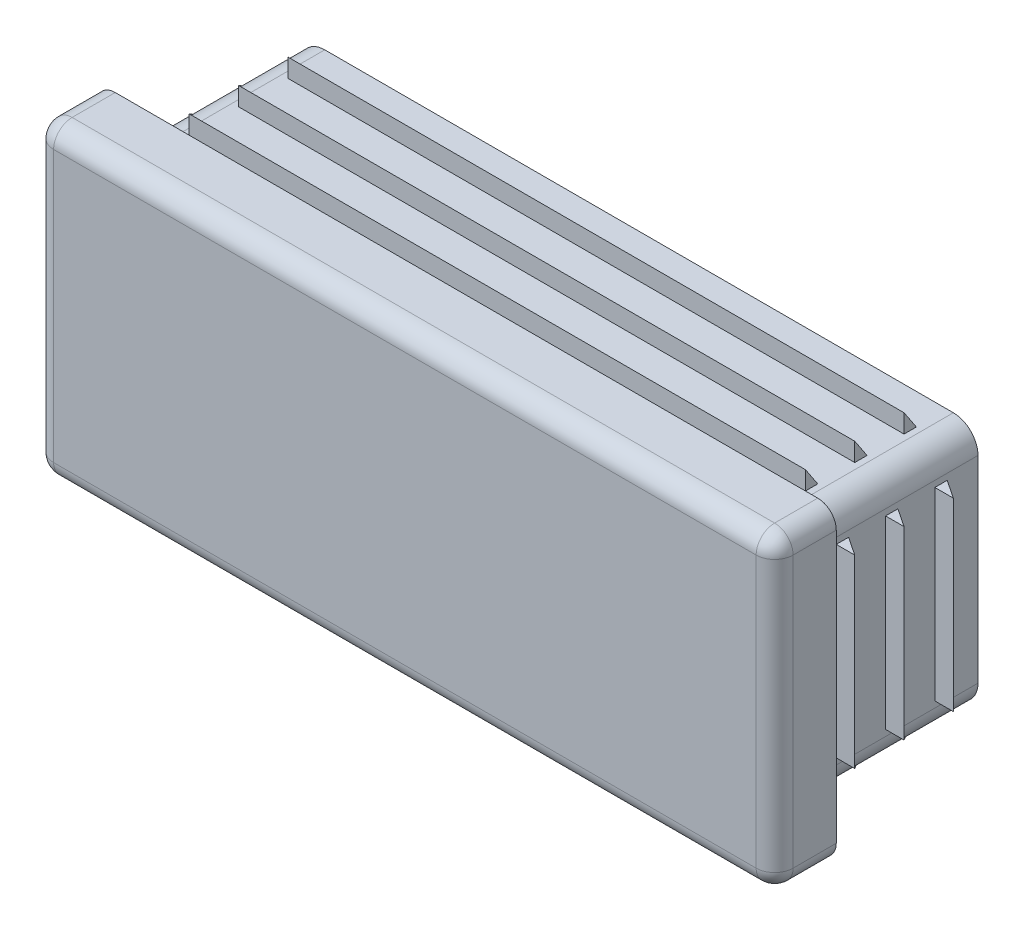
ISO-10303-21;
HEADER;
FILE_DESCRIPTION(('STEP AP214'),'2;1');
FILE_NAME('part.step','',(''),(''),'','','');
FILE_SCHEMA(('AUTOMOTIVE_DESIGN { 1 0 10303 214 1 1 1 1 }'));
ENDSEC;
DATA;
#1=APPLICATION_CONTEXT('core data for automotive mechanical design processes');
#2=APPLICATION_PROTOCOL_DEFINITION('international standard','automotive_design',2000,#1);
#3=PRODUCT_CONTEXT('',#1,'mechanical');
#4=PRODUCT('Part','Part','',(#3));
#5=PRODUCT_RELATED_PRODUCT_CATEGORY('part','',(#4));
#6=PRODUCT_DEFINITION_FORMATION('','',#4);
#7=PRODUCT_DEFINITION_CONTEXT('part definition',#1,'design');
#8=PRODUCT_DEFINITION('design','',#6,#7);
#9=PRODUCT_DEFINITION_SHAPE('','',#8);
#10=(LENGTH_UNIT() NAMED_UNIT(*) SI_UNIT(.MILLI.,.METRE.));
#11=(NAMED_UNIT(*) PLANE_ANGLE_UNIT() SI_UNIT($,.RADIAN.));
#12=(NAMED_UNIT(*) SI_UNIT($,.STERADIAN.) SOLID_ANGLE_UNIT());
#13=UNCERTAINTY_MEASURE_WITH_UNIT(LENGTH_MEASURE(1.E-05),#10,'distance_accuracy_value','');
#14=(GEOMETRIC_REPRESENTATION_CONTEXT(3) GLOBAL_UNCERTAINTY_ASSIGNED_CONTEXT((#13)) GLOBAL_UNIT_ASSIGNED_CONTEXT((#10,
#11,#12)) REPRESENTATION_CONTEXT('',''));
#15=CARTESIAN_POINT('',(0.,0.,0.));
#16=DIRECTION('',(0.,0.,1.));
#17=DIRECTION('',(1.,0.,0.));
#18=AXIS2_PLACEMENT_3D('',#15,#16,#17);
#19=CARTESIAN_POINT('',(0.,0.,14.));
#20=DIRECTION('',(0.,0.,1.));
#21=DIRECTION('',(1.,0.,0.));
#22=AXIS2_PLACEMENT_3D('',#19,#20,#21);
#23=PLANE('',#22);
#24=CARTESIAN_POINT('',(25.,7.5,14.));
#25=DIRECTION('',(0.,0.,-1.));
#26=DIRECTION('',(-1.,0.,0.));
#27=AXIS2_PLACEMENT_3D('',#24,#25,#26);
#28=CIRCLE('',#27,1.5);
#29=CARTESIAN_POINT('',(25.,9.,14.));
#30=VERTEX_POINT('',#29);
#31=CARTESIAN_POINT('',(26.5,7.5,14.));
#32=VERTEX_POINT('',#31);
#33=EDGE_CURVE('E406',#30,#32,#28,.T.);
#34=ORIENTED_EDGE('',*,*,#33,.T.);
#35=DIRECTION('',(0.,1.,0.));
#36=VECTOR('',#35,1.);
#37=CARTESIAN_POINT('',(26.5,-9.,14.));
#38=LINE('',#37,#36);
#39=CARTESIAN_POINT('',(26.5,-7.5,14.));
#40=VERTEX_POINT('',#39);
#41=EDGE_CURVE('E402',#40,#32,#38,.T.);
#42=ORIENTED_EDGE('',*,*,#41,.F.);
#43=CARTESIAN_POINT('',(25.,-7.5,14.));
#44=DIRECTION('',(0.,0.,-1.));
#45=DIRECTION('',(-1.,0.,0.));
#46=AXIS2_PLACEMENT_3D('',#43,#44,#45);
#47=CIRCLE('',#46,1.5);
#48=CARTESIAN_POINT('',(25.,-9.,14.));
#49=VERTEX_POINT('',#48);
#50=EDGE_CURVE('E18',#40,#49,#47,.T.);
#51=ORIENTED_EDGE('',*,*,#50,.T.);
#52=DIRECTION('',(1.,0.,0.));
#53=VECTOR('',#52,1.);
#54=CARTESIAN_POINT('',(-26.5,-9.,14.));
#55=LINE('',#54,#53);
#56=CARTESIAN_POINT('',(-25.,-9.,14.));
#57=VERTEX_POINT('',#56);
#58=EDGE_CURVE('E420',#57,#49,#55,.T.);
#59=ORIENTED_EDGE('',*,*,#58,.F.);
#60=CARTESIAN_POINT('',(-25.,-7.5,14.));
#61=DIRECTION('',(0.,0.,-1.));
#62=DIRECTION('',(-1.,0.,0.));
#63=AXIS2_PLACEMENT_3D('',#60,#61,#62);
#64=CIRCLE('',#63,1.5);
#65=CARTESIAN_POINT('',(-26.5,-7.5,14.));
#66=VERTEX_POINT('',#65);
#67=EDGE_CURVE('E450',#57,#66,#64,.T.);
#68=ORIENTED_EDGE('',*,*,#67,.T.);
#69=DIRECTION('',(0.,1.,0.));
#70=VECTOR('',#69,1.);
#71=CARTESIAN_POINT('',(-26.5,9.,14.));
#72=LINE('',#71,#70);
#73=CARTESIAN_POINT('',(-26.5,7.5,14.));
#74=VERTEX_POINT('',#73);
#75=EDGE_CURVE('E446',#74,#66,#72,.F.);
#76=ORIENTED_EDGE('',*,*,#75,.F.);
#77=CARTESIAN_POINT('',(-25.,7.5,14.));
#78=DIRECTION('',(0.,0.,-1.));
#79=DIRECTION('',(-1.,0.,0.));
#80=AXIS2_PLACEMENT_3D('',#77,#78,#79);
#81=CIRCLE('',#80,1.5);
#82=CARTESIAN_POINT('',(-25.,9.,14.));
#83=VERTEX_POINT('',#82);
#84=EDGE_CURVE('E442',#74,#83,#81,.T.);
#85=ORIENTED_EDGE('',*,*,#84,.T.);
#86=DIRECTION('',(1.,0.,0.));
#87=VECTOR('',#86,1.);
#88=CARTESIAN_POINT('',(26.5,9.,14.));
#89=LINE('',#88,#87);
#90=EDGE_CURVE('E438',#30,#83,#89,.F.);
#91=ORIENTED_EDGE('',*,*,#90,.F.);
#92=EDGE_LOOP('',(#34,#42,#51,#59,#68,#76,#85,#91));
#93=FACE_BOUND('',#92,.T.);
#94=ADVANCED_FACE('F15',(#93),#23,.F.);
#95=CARTESIAN_POINT('',(0.,-7.5,0.));
#96=DIRECTION('',(0.,-1.,0.));
#97=DIRECTION('',(0.,0.,-1.));
#98=AXIS2_PLACEMENT_3D('',#95,#96,#97);
#99=PLANE('',#98);
#100=DIRECTION('',(1.,0.,0.));
#101=VECTOR('',#100,1.);
#102=CARTESIAN_POINT('',(0.,-7.5,3.5));
#103=LINE('',#102,#101);
#104=CARTESIAN_POINT('',(-27.5,-7.5,3.5));
#105=VERTEX_POINT('',#104);
#106=CARTESIAN_POINT('',(-29.,-7.5,3.5));
#107=VERTEX_POINT('',#106);
#108=EDGE_CURVE('E512',#105,#107,#103,.F.);
#109=ORIENTED_EDGE('',*,*,#108,.T.);
#110=DIRECTION('',(0.832050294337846,0.,-0.554700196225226));
#111=VECTOR('',#110,1.);
#112=CARTESIAN_POINT('',(-29.,-7.5,3.5));
#113=LINE('',#112,#111);
#114=CARTESIAN_POINT('',(-27.5,-7.5,2.5));
#115=VERTEX_POINT('',#114);
#116=EDGE_CURVE('E717',#107,#115,#113,.T.);
#117=ORIENTED_EDGE('',*,*,#116,.T.);
#118=DIRECTION('',(0.,0.,-1.));
#119=VECTOR('',#118,1.);
#120=CARTESIAN_POINT('',(-27.5,-7.5,0.));
#121=LINE('',#120,#119);
#122=EDGE_CURVE('E514',#115,#105,#121,.F.);
#123=ORIENTED_EDGE('',*,*,#122,.T.);
#124=EDGE_LOOP('',(#109,#117,#123));
#125=FACE_BOUND('',#124,.T.);
#126=ADVANCED_FACE('F1758',(#125),#99,.T.);
#127=CARTESIAN_POINT('',(0.,7.5,0.));
#128=DIRECTION('',(0.,-1.,0.));
#129=DIRECTION('',(0.,0.,-1.));
#130=AXIS2_PLACEMENT_3D('',#127,#128,#129);
#131=PLANE('',#130);
#132=DIRECTION('',(0.832050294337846,0.,-0.554700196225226));
#133=VECTOR('',#132,1.);
#134=CARTESIAN_POINT('',(-29.,7.5,3.5));
#135=LINE('',#134,#133);
#136=CARTESIAN_POINT('',(-27.5,7.5,2.5));
#137=VERTEX_POINT('',#136);
#138=CARTESIAN_POINT('',(-29.,7.5,3.5));
#139=VERTEX_POINT('',#138);
#140=EDGE_CURVE('E714',#137,#139,#135,.F.);
#141=ORIENTED_EDGE('',*,*,#140,.T.);
#142=DIRECTION('',(1.,0.,0.));
#143=VECTOR('',#142,1.);
#144=CARTESIAN_POINT('',(0.,7.5,3.5));
#145=LINE('',#144,#143);
#146=CARTESIAN_POINT('',(-27.5,7.5,3.5));
#147=VERTEX_POINT('',#146);
#148=EDGE_CURVE('E510',#147,#139,#145,.F.);
#149=ORIENTED_EDGE('',*,*,#148,.F.);
#150=DIRECTION('',(0.,0.,-1.));
#151=VECTOR('',#150,1.);
#152=CARTESIAN_POINT('',(-27.5,7.5,0.));
#153=LINE('',#152,#151);
#154=EDGE_CURVE('E508',#137,#147,#153,.F.);
#155=ORIENTED_EDGE('',*,*,#154,.F.);
#156=EDGE_LOOP('',(#141,#149,#155));
#157=FACE_BOUND('',#156,.T.);
#158=ADVANCED_FACE('F1749',(#157),#131,.F.);
#159=CARTESIAN_POINT('',(0.,-7.5,0.));
#160=DIRECTION('',(0.,-1.,0.));
#161=DIRECTION('',(0.,0.,-1.));
#162=AXIS2_PLACEMENT_3D('',#159,#160,#161);
#163=PLANE('',#162);
#164=DIRECTION('',(1.,0.,0.));
#165=VECTOR('',#164,1.);
#166=CARTESIAN_POINT('',(0.,-7.5,7.5));
#167=LINE('',#166,#165);
#168=CARTESIAN_POINT('',(-27.5,-7.5,7.5));
#169=VERTEX_POINT('',#168);
#170=CARTESIAN_POINT('',(-29.,-7.5,7.5));
#171=VERTEX_POINT('',#170);
#172=EDGE_CURVE('E503',#169,#171,#167,.F.);
#173=ORIENTED_EDGE('',*,*,#172,.T.);
#174=DIRECTION('',(0.832050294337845,0.,-0.554700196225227));
#175=VECTOR('',#174,1.);
#176=CARTESIAN_POINT('',(-29.,-7.5,7.5));
#177=LINE('',#176,#175);
#178=CARTESIAN_POINT('',(-27.5,-7.5,6.5));
#179=VERTEX_POINT('',#178);
#180=EDGE_CURVE('E708',#171,#179,#177,.T.);
#181=ORIENTED_EDGE('',*,*,#180,.T.);
#182=DIRECTION('',(0.,0.,-1.));
#183=VECTOR('',#182,1.);
#184=CARTESIAN_POINT('',(-27.5,-7.5,0.));
#185=LINE('',#184,#183);
#186=EDGE_CURVE('E505',#179,#169,#185,.F.);
#187=ORIENTED_EDGE('',*,*,#186,.T.);
#188=EDGE_LOOP('',(#173,#181,#187));
#189=FACE_BOUND('',#188,.T.);
#190=ADVANCED_FACE('F1740',(#189),#163,.T.);
#191=CARTESIAN_POINT('',(0.,7.5,0.));
#192=DIRECTION('',(0.,-1.,0.));
#193=DIRECTION('',(0.,0.,-1.));
#194=AXIS2_PLACEMENT_3D('',#191,#192,#193);
#195=PLANE('',#194);
#196=DIRECTION('',(0.832050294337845,0.,-0.554700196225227));
#197=VECTOR('',#196,1.);
#198=CARTESIAN_POINT('',(-29.,7.5,7.5));
#199=LINE('',#198,#197);
#200=CARTESIAN_POINT('',(-27.5,7.5,6.5));
#201=VERTEX_POINT('',#200);
#202=CARTESIAN_POINT('',(-29.,7.5,7.5));
#203=VERTEX_POINT('',#202);
#204=EDGE_CURVE('E705',#201,#203,#199,.F.);
#205=ORIENTED_EDGE('',*,*,#204,.T.);
#206=DIRECTION('',(1.,0.,0.));
#207=VECTOR('',#206,1.);
#208=CARTESIAN_POINT('',(0.,7.5,7.5));
#209=LINE('',#208,#207);
#210=CARTESIAN_POINT('',(-27.5,7.5,7.5));
#211=VERTEX_POINT('',#210);
#212=EDGE_CURVE('E501',#211,#203,#209,.F.);
#213=ORIENTED_EDGE('',*,*,#212,.F.);
#214=DIRECTION('',(0.,0.,-1.));
#215=VECTOR('',#214,1.);
#216=CARTESIAN_POINT('',(-27.5,7.5,0.));
#217=LINE('',#216,#215);
#218=EDGE_CURVE('E499',#201,#211,#217,.F.);
#219=ORIENTED_EDGE('',*,*,#218,.F.);
#220=EDGE_LOOP('',(#205,#213,#219));
#221=FACE_BOUND('',#220,.T.);
#222=ADVANCED_FACE('F1731',(#221),#195,.F.);
#223=CARTESIAN_POINT('',(0.,-7.5,0.));
#224=DIRECTION('',(0.,-1.,0.));
#225=DIRECTION('',(0.,0.,-1.));
#226=AXIS2_PLACEMENT_3D('',#223,#224,#225);
#227=PLANE('',#226);
#228=DIRECTION('',(1.,0.,0.));
#229=VECTOR('',#228,1.);
#230=CARTESIAN_POINT('',(0.,-7.5,11.5));
#231=LINE('',#230,#229);
#232=CARTESIAN_POINT('',(-27.5,-7.5,11.5));
#233=VERTEX_POINT('',#232);
#234=CARTESIAN_POINT('',(-29.,-7.5,11.5));
#235=VERTEX_POINT('',#234);
#236=EDGE_CURVE('E494',#233,#235,#231,.F.);
#237=ORIENTED_EDGE('',*,*,#236,.T.);
#238=DIRECTION('',(0.832050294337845,0.,-0.554700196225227));
#239=VECTOR('',#238,1.);
#240=CARTESIAN_POINT('',(-29.,-7.5,11.5));
#241=LINE('',#240,#239);
#242=CARTESIAN_POINT('',(-27.5,-7.5,10.5));
#243=VERTEX_POINT('',#242);
#244=EDGE_CURVE('E699',#235,#243,#241,.T.);
#245=ORIENTED_EDGE('',*,*,#244,.T.);
#246=DIRECTION('',(0.,0.,-1.));
#247=VECTOR('',#246,1.);
#248=CARTESIAN_POINT('',(-27.5,-7.5,0.));
#249=LINE('',#248,#247);
#250=EDGE_CURVE('E496',#243,#233,#249,.F.);
#251=ORIENTED_EDGE('',*,*,#250,.T.);
#252=EDGE_LOOP('',(#237,#245,#251));
#253=FACE_BOUND('',#252,.T.);
#254=ADVANCED_FACE('F1722',(#253),#227,.T.);
#255=CARTESIAN_POINT('',(0.,7.5,0.));
#256=DIRECTION('',(0.,-1.,0.));
#257=DIRECTION('',(0.,0.,-1.));
#258=AXIS2_PLACEMENT_3D('',#255,#256,#257);
#259=PLANE('',#258);
#260=DIRECTION('',(0.832050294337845,0.,-0.554700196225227));
#261=VECTOR('',#260,1.);
#262=CARTESIAN_POINT('',(-29.,7.5,11.5));
#263=LINE('',#262,#261);
#264=CARTESIAN_POINT('',(-27.5,7.5,10.5));
#265=VERTEX_POINT('',#264);
#266=CARTESIAN_POINT('',(-29.,7.5,11.5));
#267=VERTEX_POINT('',#266);
#268=EDGE_CURVE('E696',#265,#267,#263,.F.);
#269=ORIENTED_EDGE('',*,*,#268,.T.);
#270=DIRECTION('',(1.,0.,0.));
#271=VECTOR('',#270,1.);
#272=CARTESIAN_POINT('',(0.,7.5,11.5));
#273=LINE('',#272,#271);
#274=CARTESIAN_POINT('',(-27.5,7.5,11.5));
#275=VERTEX_POINT('',#274);
#276=EDGE_CURVE('E492',#275,#267,#273,.F.);
#277=ORIENTED_EDGE('',*,*,#276,.F.);
#278=DIRECTION('',(0.,0.,-1.));
#279=VECTOR('',#278,1.);
#280=CARTESIAN_POINT('',(-27.5,7.5,0.));
#281=LINE('',#280,#279);
#282=EDGE_CURVE('E490',#265,#275,#281,.F.);
#283=ORIENTED_EDGE('',*,*,#282,.F.);
#284=EDGE_LOOP('',(#269,#277,#283));
#285=FACE_BOUND('',#284,.T.);
#286=ADVANCED_FACE('F1713',(#285),#259,.F.);
#287=CARTESIAN_POINT('',(25.,0.,0.));
#288=DIRECTION('',(1.,0.,0.));
#289=DIRECTION('',(0.,1.,0.));
#290=AXIS2_PLACEMENT_3D('',#287,#288,#289);
#291=PLANE('',#290);
#292=DIRECTION('',(0.,0.,1.));
#293=VECTOR('',#292,1.);
#294=CARTESIAN_POINT('',(25.,10.,0.));
#295=LINE('',#294,#293);
#296=CARTESIAN_POINT('',(25.,10.,11.5));
#297=VERTEX_POINT('',#296);
#298=CARTESIAN_POINT('',(25.,10.,10.5));
#299=VERTEX_POINT('',#298);
#300=EDGE_CURVE('E488',#297,#299,#295,.F.);
#301=ORIENTED_EDGE('',*,*,#300,.T.);
#302=DIRECTION('',(0.,-0.832050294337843,-0.554700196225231));
#303=VECTOR('',#302,1.);
#304=CARTESIAN_POINT('',(25.,10.,10.5));
#305=LINE('',#304,#303);
#306=CARTESIAN_POINT('',(25.,11.5,11.5));
#307=VERTEX_POINT('',#306);
#308=EDGE_CURVE('E683',#299,#307,#305,.F.);
#309=ORIENTED_EDGE('',*,*,#308,.T.);
#310=DIRECTION('',(0.,1.,0.));
#311=VECTOR('',#310,1.);
#312=CARTESIAN_POINT('',(25.,11.5,11.5));
#313=LINE('',#312,#311);
#314=EDGE_CURVE('E687',#307,#297,#313,.F.);
#315=ORIENTED_EDGE('',*,*,#314,.T.);
#316=EDGE_LOOP('',(#301,#309,#315));
#317=FACE_BOUND('',#316,.T.);
#318=ADVANCED_FACE('F1704',(#317),#291,.T.);
#319=CARTESIAN_POINT('',(-25.,0.,0.));
#320=DIRECTION('',(1.,0.,0.));
#321=DIRECTION('',(0.,1.,0.));
#322=AXIS2_PLACEMENT_3D('',#319,#320,#321);
#323=PLANE('',#322);
#324=DIRECTION('',(0.,-0.832050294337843,-0.554700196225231));
#325=VECTOR('',#324,1.);
#326=CARTESIAN_POINT('',(-25.,10.,10.5));
#327=LINE('',#326,#325);
#328=CARTESIAN_POINT('',(-25.,11.5,11.5));
#329=VERTEX_POINT('',#328);
#330=CARTESIAN_POINT('',(-25.,10.,10.5));
#331=VERTEX_POINT('',#330);
#332=EDGE_CURVE('E677',#329,#331,#327,.T.);
#333=ORIENTED_EDGE('',*,*,#332,.T.);
#334=DIRECTION('',(0.,0.,1.));
#335=VECTOR('',#334,1.);
#336=CARTESIAN_POINT('',(-25.,10.,0.));
#337=LINE('',#336,#335);
#338=CARTESIAN_POINT('',(-25.,10.,11.5));
#339=VERTEX_POINT('',#338);
#340=EDGE_CURVE('E486',#339,#331,#337,.F.);
#341=ORIENTED_EDGE('',*,*,#340,.F.);
#342=DIRECTION('',(0.,1.,0.));
#343=VECTOR('',#342,1.);
#344=CARTESIAN_POINT('',(-25.,11.5,11.5));
#345=LINE('',#344,#343);
#346=EDGE_CURVE('E685',#339,#329,#345,.T.);
#347=ORIENTED_EDGE('',*,*,#346,.T.);
#348=EDGE_LOOP('',(#333,#341,#347));
#349=FACE_BOUND('',#348,.T.);
#350=ADVANCED_FACE('F1695',(#349),#323,.F.);
#351=CARTESIAN_POINT('',(25.,0.,0.));
#352=DIRECTION('',(1.,0.,0.));
#353=DIRECTION('',(0.,1.,0.));
#354=AXIS2_PLACEMENT_3D('',#351,#352,#353);
#355=PLANE('',#354);
#356=DIRECTION('',(0.,0.,1.));
#357=VECTOR('',#356,1.);
#358=CARTESIAN_POINT('',(25.,10.,0.));
#359=LINE('',#358,#357);
#360=CARTESIAN_POINT('',(25.,10.,3.5));
#361=VERTEX_POINT('',#360);
#362=CARTESIAN_POINT('',(25.,10.,2.5));
#363=VERTEX_POINT('',#362);
#364=EDGE_CURVE('E484',#361,#363,#359,.F.);
#365=ORIENTED_EDGE('',*,*,#364,.T.);
#366=DIRECTION('',(0.,-0.832050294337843,-0.554700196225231));
#367=VECTOR('',#366,1.);
#368=CARTESIAN_POINT('',(25.,10.,2.5));
#369=LINE('',#368,#367);
#370=CARTESIAN_POINT('',(25.,11.5,3.5));
#371=VERTEX_POINT('',#370);
#372=EDGE_CURVE('E670',#363,#371,#369,.F.);
#373=ORIENTED_EDGE('',*,*,#372,.T.);
#374=DIRECTION('',(0.,1.,0.));
#375=VECTOR('',#374,1.);
#376=CARTESIAN_POINT('',(25.,11.5,3.5));
#377=LINE('',#376,#375);
#378=EDGE_CURVE('E674',#371,#361,#377,.F.);
#379=ORIENTED_EDGE('',*,*,#378,.T.);
#380=EDGE_LOOP('',(#365,#373,#379));
#381=FACE_BOUND('',#380,.T.);
#382=ADVANCED_FACE('F1686',(#381),#355,.T.);
#383=CARTESIAN_POINT('',(-25.,0.,0.));
#384=DIRECTION('',(1.,0.,0.));
#385=DIRECTION('',(0.,1.,0.));
#386=AXIS2_PLACEMENT_3D('',#383,#384,#385);
#387=PLANE('',#386);
#388=DIRECTION('',(0.,-0.832050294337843,-0.554700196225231));
#389=VECTOR('',#388,1.);
#390=CARTESIAN_POINT('',(-25.,10.,2.5));
#391=LINE('',#390,#389);
#392=CARTESIAN_POINT('',(-25.,11.5,3.5));
#393=VERTEX_POINT('',#392);
#394=CARTESIAN_POINT('',(-25.,10.,2.5));
#395=VERTEX_POINT('',#394);
#396=EDGE_CURVE('E664',#393,#395,#391,.T.);
#397=ORIENTED_EDGE('',*,*,#396,.T.);
#398=DIRECTION('',(0.,0.,1.));
#399=VECTOR('',#398,1.);
#400=CARTESIAN_POINT('',(-25.,10.,0.));
#401=LINE('',#400,#399);
#402=CARTESIAN_POINT('',(-25.,10.,3.5));
#403=VERTEX_POINT('',#402);
#404=EDGE_CURVE('E482',#403,#395,#401,.F.);
#405=ORIENTED_EDGE('',*,*,#404,.F.);
#406=DIRECTION('',(0.,1.,0.));
#407=VECTOR('',#406,1.);
#408=CARTESIAN_POINT('',(-25.,11.5,3.5));
#409=LINE('',#408,#407);
#410=EDGE_CURVE('E672',#403,#393,#409,.T.);
#411=ORIENTED_EDGE('',*,*,#410,.T.);
#412=EDGE_LOOP('',(#397,#405,#411));
#413=FACE_BOUND('',#412,.T.);
#414=ADVANCED_FACE('F1677',(#413),#387,.F.);
#415=CARTESIAN_POINT('',(25.,0.,0.));
#416=DIRECTION('',(1.,0.,0.));
#417=DIRECTION('',(0.,1.,0.));
#418=AXIS2_PLACEMENT_3D('',#415,#416,#417);
#419=PLANE('',#418);
#420=DIRECTION('',(0.,0.,1.));
#421=VECTOR('',#420,1.);
#422=CARTESIAN_POINT('',(25.,10.,0.));
#423=LINE('',#422,#421);
#424=CARTESIAN_POINT('',(25.,10.,7.5));
#425=VERTEX_POINT('',#424);
#426=CARTESIAN_POINT('',(25.,10.,6.5));
#427=VERTEX_POINT('',#426);
#428=EDGE_CURVE('E480',#425,#427,#423,.F.);
#429=ORIENTED_EDGE('',*,*,#428,.T.);
#430=DIRECTION('',(0.,-0.832050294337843,-0.554700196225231));
#431=VECTOR('',#430,1.);
#432=CARTESIAN_POINT('',(25.,10.,6.5));
#433=LINE('',#432,#431);
#434=CARTESIAN_POINT('',(25.,11.5,7.5));
#435=VERTEX_POINT('',#434);
#436=EDGE_CURVE('E657',#427,#435,#433,.F.);
#437=ORIENTED_EDGE('',*,*,#436,.T.);
#438=DIRECTION('',(0.,1.,0.));
#439=VECTOR('',#438,1.);
#440=CARTESIAN_POINT('',(25.,11.5,7.5));
#441=LINE('',#440,#439);
#442=EDGE_CURVE('E661',#435,#425,#441,.F.);
#443=ORIENTED_EDGE('',*,*,#442,.T.);
#444=EDGE_LOOP('',(#429,#437,#443));
#445=FACE_BOUND('',#444,.T.);
#446=ADVANCED_FACE('F1668',(#445),#419,.T.);
#447=CARTESIAN_POINT('',(-25.,0.,0.));
#448=DIRECTION('',(1.,0.,0.));
#449=DIRECTION('',(0.,1.,0.));
#450=AXIS2_PLACEMENT_3D('',#447,#448,#449);
#451=PLANE('',#450);
#452=DIRECTION('',(0.,-0.832050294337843,-0.554700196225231));
#453=VECTOR('',#452,1.);
#454=CARTESIAN_POINT('',(-25.,10.,6.5));
#455=LINE('',#454,#453);
#456=CARTESIAN_POINT('',(-25.,11.5,7.5));
#457=VERTEX_POINT('',#456);
#458=CARTESIAN_POINT('',(-25.,10.,6.5));
#459=VERTEX_POINT('',#458);
#460=EDGE_CURVE('E647',#457,#459,#455,.T.);
#461=ORIENTED_EDGE('',*,*,#460,.T.);
#462=DIRECTION('',(0.,0.,1.));
#463=VECTOR('',#462,1.);
#464=CARTESIAN_POINT('',(-25.,10.,0.));
#465=LINE('',#464,#463);
#466=CARTESIAN_POINT('',(-25.,10.,7.5));
#467=VERTEX_POINT('',#466);
#468=EDGE_CURVE('E478',#467,#459,#465,.F.);
#469=ORIENTED_EDGE('',*,*,#468,.F.);
#470=DIRECTION('',(0.,1.,0.));
#471=VECTOR('',#470,1.);
#472=CARTESIAN_POINT('',(-25.,11.5,7.5));
#473=LINE('',#472,#471);
#474=EDGE_CURVE('E659',#467,#457,#473,.T.);
#475=ORIENTED_EDGE('',*,*,#474,.T.);
#476=EDGE_LOOP('',(#461,#469,#475));
#477=FACE_BOUND('',#476,.T.);
#478=ADVANCED_FACE('F1659',(#477),#451,.F.);
#479=CARTESIAN_POINT('',(0.,7.5,0.));
#480=DIRECTION('',(0.,1.,0.));
#481=DIRECTION('',(0.,0.,1.));
#482=AXIS2_PLACEMENT_3D('',#479,#480,#481);
#483=PLANE('',#482);
#484=DIRECTION('',(1.,0.,0.));
#485=VECTOR('',#484,1.);
#486=CARTESIAN_POINT('',(0.,7.5,7.5));
#487=LINE('',#486,#485);
#488=CARTESIAN_POINT('',(27.5,7.5,7.5));
#489=VERTEX_POINT('',#488);
#490=CARTESIAN_POINT('',(29.,7.5,7.5));
#491=VERTEX_POINT('',#490);
#492=EDGE_CURVE('E473',#489,#491,#487,.T.);
#493=ORIENTED_EDGE('',*,*,#492,.T.);
#494=DIRECTION('',(-0.832050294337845,0.,-0.554700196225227));
#495=VECTOR('',#494,1.);
#496=CARTESIAN_POINT('',(29.,7.5,7.5));
#497=LINE('',#496,#495);
#498=CARTESIAN_POINT('',(27.5,7.5,6.5));
#499=VERTEX_POINT('',#498);
#500=EDGE_CURVE('E644',#499,#491,#497,.F.);
#501=ORIENTED_EDGE('',*,*,#500,.F.);
#502=DIRECTION('',(0.,0.,1.));
#503=VECTOR('',#502,1.);
#504=CARTESIAN_POINT('',(27.5,7.5,0.));
#505=LINE('',#504,#503);
#506=EDGE_CURVE('E475',#499,#489,#505,.T.);
#507=ORIENTED_EDGE('',*,*,#506,.T.);
#508=EDGE_LOOP('',(#493,#501,#507));
#509=FACE_BOUND('',#508,.T.);
#510=ADVANCED_FACE('F1650',(#509),#483,.T.);
#511=CARTESIAN_POINT('',(0.,-7.5,0.));
#512=DIRECTION('',(0.,1.,0.));
#513=DIRECTION('',(0.,0.,1.));
#514=AXIS2_PLACEMENT_3D('',#511,#512,#513);
#515=PLANE('',#514);
#516=DIRECTION('',(-0.832050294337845,0.,-0.554700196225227));
#517=VECTOR('',#516,1.);
#518=CARTESIAN_POINT('',(29.,-7.5,7.5));
#519=LINE('',#518,#517);
#520=CARTESIAN_POINT('',(29.,-7.5,7.5));
#521=VERTEX_POINT('',#520);
#522=CARTESIAN_POINT('',(27.5,-7.5,6.5));
#523=VERTEX_POINT('',#522);
#524=EDGE_CURVE('E641',#521,#523,#519,.T.);
#525=ORIENTED_EDGE('',*,*,#524,.F.);
#526=DIRECTION('',(1.,0.,0.));
#527=VECTOR('',#526,1.);
#528=CARTESIAN_POINT('',(0.,-7.5,7.5));
#529=LINE('',#528,#527);
#530=CARTESIAN_POINT('',(27.5,-7.5,7.5));
#531=VERTEX_POINT('',#530);
#532=EDGE_CURVE('E471',#531,#521,#529,.T.);
#533=ORIENTED_EDGE('',*,*,#532,.F.);
#534=DIRECTION('',(0.,0.,1.));
#535=VECTOR('',#534,1.);
#536=CARTESIAN_POINT('',(27.5,-7.5,0.));
#537=LINE('',#536,#535);
#538=EDGE_CURVE('E469',#523,#531,#537,.T.);
#539=ORIENTED_EDGE('',*,*,#538,.F.);
#540=EDGE_LOOP('',(#525,#533,#539));
#541=FACE_BOUND('',#540,.T.);
#542=ADVANCED_FACE('F1641',(#541),#515,.F.);
#543=CARTESIAN_POINT('',(0.,7.5,0.));
#544=DIRECTION('',(0.,1.,0.));
#545=DIRECTION('',(0.,0.,1.));
#546=AXIS2_PLACEMENT_3D('',#543,#544,#545);
#547=PLANE('',#546);
#548=DIRECTION('',(1.,0.,0.));
#549=VECTOR('',#548,1.);
#550=CARTESIAN_POINT('',(0.,7.5,11.5));
#551=LINE('',#550,#549);
#552=CARTESIAN_POINT('',(27.5,7.5,11.5));
#553=VERTEX_POINT('',#552);
#554=CARTESIAN_POINT('',(29.,7.5,11.5));
#555=VERTEX_POINT('',#554);
#556=EDGE_CURVE('E464',#553,#555,#551,.T.);
#557=ORIENTED_EDGE('',*,*,#556,.T.);
#558=DIRECTION('',(-0.832050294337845,0.,-0.554700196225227));
#559=VECTOR('',#558,1.);
#560=CARTESIAN_POINT('',(29.,7.5,11.5));
#561=LINE('',#560,#559);
#562=CARTESIAN_POINT('',(27.5,7.5,10.5));
#563=VERTEX_POINT('',#562);
#564=EDGE_CURVE('E635',#563,#555,#561,.F.);
#565=ORIENTED_EDGE('',*,*,#564,.F.);
#566=DIRECTION('',(0.,0.,1.));
#567=VECTOR('',#566,1.);
#568=CARTESIAN_POINT('',(27.5,7.5,0.));
#569=LINE('',#568,#567);
#570=EDGE_CURVE('E466',#563,#553,#569,.T.);
#571=ORIENTED_EDGE('',*,*,#570,.T.);
#572=EDGE_LOOP('',(#557,#565,#571));
#573=FACE_BOUND('',#572,.T.);
#574=ADVANCED_FACE('F1632',(#573),#547,.T.);
#575=CARTESIAN_POINT('',(0.,-7.5,0.));
#576=DIRECTION('',(0.,1.,0.));
#577=DIRECTION('',(0.,0.,1.));
#578=AXIS2_PLACEMENT_3D('',#575,#576,#577);
#579=PLANE('',#578);
#580=DIRECTION('',(-0.832050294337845,0.,-0.554700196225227));
#581=VECTOR('',#580,1.);
#582=CARTESIAN_POINT('',(29.,-7.5,11.5));
#583=LINE('',#582,#581);
#584=CARTESIAN_POINT('',(29.,-7.5,11.5));
#585=VERTEX_POINT('',#584);
#586=CARTESIAN_POINT('',(27.5,-7.5,10.5));
#587=VERTEX_POINT('',#586);
#588=EDGE_CURVE('E632',#585,#587,#583,.T.);
#589=ORIENTED_EDGE('',*,*,#588,.F.);
#590=DIRECTION('',(1.,0.,0.));
#591=VECTOR('',#590,1.);
#592=CARTESIAN_POINT('',(0.,-7.5,11.5));
#593=LINE('',#592,#591);
#594=CARTESIAN_POINT('',(27.5,-7.5,11.5));
#595=VERTEX_POINT('',#594);
#596=EDGE_CURVE('E462',#595,#585,#593,.T.);
#597=ORIENTED_EDGE('',*,*,#596,.F.);
#598=DIRECTION('',(0.,0.,1.));
#599=VECTOR('',#598,1.);
#600=CARTESIAN_POINT('',(27.5,-7.5,0.));
#601=LINE('',#600,#599);
#602=EDGE_CURVE('E460',#587,#595,#601,.T.);
#603=ORIENTED_EDGE('',*,*,#602,.F.);
#604=EDGE_LOOP('',(#589,#597,#603));
#605=FACE_BOUND('',#604,.T.);
#606=ADVANCED_FACE('F1623',(#605),#579,.F.);
#607=CARTESIAN_POINT('',(0.,7.5,0.));
#608=DIRECTION('',(0.,1.,0.));
#609=DIRECTION('',(0.,0.,1.));
#610=AXIS2_PLACEMENT_3D('',#607,#608,#609);
#611=PLANE('',#610);
#612=DIRECTION('',(1.,0.,0.));
#613=VECTOR('',#612,1.);
#614=CARTESIAN_POINT('',(0.,7.5,3.5));
#615=LINE('',#614,#613);
#616=CARTESIAN_POINT('',(27.5,7.5,3.5));
#617=VERTEX_POINT('',#616);
#618=CARTESIAN_POINT('',(29.,7.5,3.5));
#619=VERTEX_POINT('',#618);
#620=EDGE_CURVE('E455',#617,#619,#615,.T.);
#621=ORIENTED_EDGE('',*,*,#620,.T.);
#622=DIRECTION('',(-0.83205029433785,0.,-0.554700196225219));
#623=VECTOR('',#622,1.);
#624=CARTESIAN_POINT('',(29.,7.5,3.5));
#625=LINE('',#624,#623);
#626=CARTESIAN_POINT('',(27.5,7.5,2.5));
#627=VERTEX_POINT('',#626);
#628=EDGE_CURVE('E626',#627,#619,#625,.F.);
#629=ORIENTED_EDGE('',*,*,#628,.F.);
#630=DIRECTION('',(0.,0.,1.));
#631=VECTOR('',#630,1.);
#632=CARTESIAN_POINT('',(27.5,7.5,0.));
#633=LINE('',#632,#631);
#634=EDGE_CURVE('E457',#627,#617,#633,.T.);
#635=ORIENTED_EDGE('',*,*,#634,.T.);
#636=EDGE_LOOP('',(#621,#629,#635));
#637=FACE_BOUND('',#636,.T.);
#638=ADVANCED_FACE('F1614',(#637),#611,.T.);
#639=CARTESIAN_POINT('',(0.,-7.5,0.));
#640=DIRECTION('',(0.,1.,0.));
#641=DIRECTION('',(0.,0.,1.));
#642=AXIS2_PLACEMENT_3D('',#639,#640,#641);
#643=PLANE('',#642);
#644=DIRECTION('',(-0.83205029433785,0.,-0.554700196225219));
#645=VECTOR('',#644,1.);
#646=CARTESIAN_POINT('',(29.,-7.5,3.5));
#647=LINE('',#646,#645);
#648=CARTESIAN_POINT('',(29.,-7.5,3.5));
#649=VERTEX_POINT('',#648);
#650=CARTESIAN_POINT('',(27.5,-7.5,2.5));
#651=VERTEX_POINT('',#650);
#652=EDGE_CURVE('E623',#649,#651,#647,.T.);
#653=ORIENTED_EDGE('',*,*,#652,.F.);
#654=DIRECTION('',(1.,0.,0.));
#655=VECTOR('',#654,1.);
#656=CARTESIAN_POINT('',(0.,-7.5,3.5));
#657=LINE('',#656,#655);
#658=CARTESIAN_POINT('',(27.5,-7.5,3.5));
#659=VERTEX_POINT('',#658);
#660=EDGE_CURVE('E453',#659,#649,#657,.T.);
#661=ORIENTED_EDGE('',*,*,#660,.F.);
#662=DIRECTION('',(0.,0.,1.));
#663=VECTOR('',#662,1.);
#664=CARTESIAN_POINT('',(27.5,-7.5,0.));
#665=LINE('',#664,#663);
#666=EDGE_CURVE('E421',#651,#659,#665,.T.);
#667=ORIENTED_EDGE('',*,*,#666,.F.);
#668=EDGE_LOOP('',(#653,#661,#667));
#669=FACE_BOUND('',#668,.T.);
#670=ADVANCED_FACE('F1606',(#669),#643,.F.);
#671=CARTESIAN_POINT('',(25.,-7.5,14.));
#672=DIRECTION('',(0.,0.,-1.));
#673=DIRECTION('',(-1.,0.,0.));
#674=AXIS2_PLACEMENT_3D('',#671,#672,#673);
#675=CYLINDRICAL_SURFACE('',#674,1.5);
#676=DIRECTION('',(0.,0.,1.));
#677=VECTOR('',#676,1.);
#678=CARTESIAN_POINT('',(26.5,-7.5,14.));
#679=LINE('',#678,#677);
#680=CARTESIAN_POINT('',(26.5,-7.5,0.));
#681=VERTEX_POINT('',#680);
#682=EDGE_CURVE('E415',#681,#40,#679,.T.);
#683=ORIENTED_EDGE('',*,*,#682,.F.);
#684=CARTESIAN_POINT('',(25.,-7.5,0.));
#685=DIRECTION('',(0.,0.,-1.));
#686=DIRECTION('',(-1.,0.,0.));
#687=AXIS2_PLACEMENT_3D('',#684,#685,#686);
#688=CIRCLE('',#687,1.5);
#689=CARTESIAN_POINT('',(25.,-9.,0.));
#690=VERTEX_POINT('',#689);
#691=EDGE_CURVE('E572',#681,#690,#688,.T.);
#692=ORIENTED_EDGE('',*,*,#691,.T.);
#693=DIRECTION('',(0.,0.,1.));
#694=VECTOR('',#693,1.);
#695=CARTESIAN_POINT('',(25.,-9.,14.));
#696=LINE('',#695,#694);
#697=EDGE_CURVE('E418',#49,#690,#696,.F.);
#698=ORIENTED_EDGE('',*,*,#697,.F.);
#699=ORIENTED_EDGE('',*,*,#50,.F.);
#700=EDGE_LOOP('',(#683,#692,#698,#699));
#701=FACE_BOUND('',#700,.T.);
#702=ADVANCED_FACE('F414',(#701),#675,.F.);
#703=CARTESIAN_POINT('',(-26.5,-9.,14.));
#704=DIRECTION('',(0.,1.,0.));
#705=DIRECTION('',(0.,0.,1.));
#706=AXIS2_PLACEMENT_3D('',#703,#704,#705);
#707=PLANE('',#706);
#708=ORIENTED_EDGE('',*,*,#58,.T.);
#709=ORIENTED_EDGE('',*,*,#697,.T.);
#710=DIRECTION('',(1.,0.,0.));
#711=VECTOR('',#710,1.);
#712=CARTESIAN_POINT('',(0.,-9.,0.));
#713=LINE('',#712,#711);
#714=CARTESIAN_POINT('',(-25.,-9.,0.));
#715=VERTEX_POINT('',#714);
#716=EDGE_CURVE('E571',#690,#715,#713,.F.);
#717=ORIENTED_EDGE('',*,*,#716,.T.);
#718=DIRECTION('',(0.,0.,-1.));
#719=VECTOR('',#718,1.);
#720=CARTESIAN_POINT('',(-25.,-9.,14.));
#721=LINE('',#720,#719);
#722=EDGE_CURVE('E447',#715,#57,#721,.F.);
#723=ORIENTED_EDGE('',*,*,#722,.T.);
#724=EDGE_LOOP('',(#708,#709,#717,#723));
#725=FACE_BOUND('',#724,.T.);
#726=ADVANCED_FACE('F1590',(#725),#707,.T.);
#727=CARTESIAN_POINT('',(-25.,-7.5,14.));
#728=DIRECTION('',(0.,0.,-1.));
#729=DIRECTION('',(-1.,0.,0.));
#730=AXIS2_PLACEMENT_3D('',#727,#728,#729);
#731=CYLINDRICAL_SURFACE('',#730,1.5);
#732=ORIENTED_EDGE('',*,*,#722,.F.);
#733=CARTESIAN_POINT('',(-25.,-7.5,0.));
#734=DIRECTION('',(0.,0.,-1.));
#735=DIRECTION('',(-1.,0.,0.));
#736=AXIS2_PLACEMENT_3D('',#733,#734,#735);
#737=CIRCLE('',#736,1.5);
#738=CARTESIAN_POINT('',(-26.5,-7.5,0.));
#739=VERTEX_POINT('',#738);
#740=EDGE_CURVE('E569',#715,#739,#737,.T.);
#741=ORIENTED_EDGE('',*,*,#740,.T.);
#742=DIRECTION('',(0.,0.,-1.));
#743=VECTOR('',#742,1.);
#744=CARTESIAN_POINT('',(-26.5,-7.5,14.));
#745=LINE('',#744,#743);
#746=EDGE_CURVE('E443',#66,#739,#745,.T.);
#747=ORIENTED_EDGE('',*,*,#746,.F.);
#748=ORIENTED_EDGE('',*,*,#67,.F.);
#749=EDGE_LOOP('',(#732,#741,#747,#748));
#750=FACE_BOUND('',#749,.T.);
#751=ADVANCED_FACE('F580',(#750),#731,.F.);
#752=CARTESIAN_POINT('',(-26.5,9.,14.));
#753=DIRECTION('',(1.,0.,0.));
#754=DIRECTION('',(0.,0.,-1.));
#755=AXIS2_PLACEMENT_3D('',#752,#753,#754);
#756=PLANE('',#755);
#757=ORIENTED_EDGE('',*,*,#75,.T.);
#758=ORIENTED_EDGE('',*,*,#746,.T.);
#759=DIRECTION('',(0.,1.,0.));
#760=VECTOR('',#759,1.);
#761=CARTESIAN_POINT('',(-26.5,0.,0.));
#762=LINE('',#761,#760);
#763=CARTESIAN_POINT('',(-26.5,7.5,0.));
#764=VERTEX_POINT('',#763);
#765=EDGE_CURVE('E568',#739,#764,#762,.T.);
#766=ORIENTED_EDGE('',*,*,#765,.T.);
#767=DIRECTION('',(0.,0.,-1.));
#768=VECTOR('',#767,1.);
#769=CARTESIAN_POINT('',(-26.5,7.5,14.));
#770=LINE('',#769,#768);
#771=EDGE_CURVE('E439',#764,#74,#770,.F.);
#772=ORIENTED_EDGE('',*,*,#771,.T.);
#773=EDGE_LOOP('',(#757,#758,#766,#772));
#774=FACE_BOUND('',#773,.T.);
#775=ADVANCED_FACE('F584',(#774),#756,.T.);
#776=CARTESIAN_POINT('',(-25.,7.5,14.));
#777=DIRECTION('',(0.,0.,-1.));
#778=DIRECTION('',(-1.,0.,0.));
#779=AXIS2_PLACEMENT_3D('',#776,#777,#778);
#780=CYLINDRICAL_SURFACE('',#779,1.5);
#781=ORIENTED_EDGE('',*,*,#771,.F.);
#782=CARTESIAN_POINT('',(-25.,7.5,0.));
#783=DIRECTION('',(0.,0.,-1.));
#784=DIRECTION('',(-1.,0.,0.));
#785=AXIS2_PLACEMENT_3D('',#782,#783,#784);
#786=CIRCLE('',#785,1.5);
#787=CARTESIAN_POINT('',(-25.,9.,0.));
#788=VERTEX_POINT('',#787);
#789=EDGE_CURVE('E566',#764,#788,#786,.T.);
#790=ORIENTED_EDGE('',*,*,#789,.T.);
#791=DIRECTION('',(0.,0.,1.));
#792=VECTOR('',#791,1.);
#793=CARTESIAN_POINT('',(-25.,9.,14.));
#794=LINE('',#793,#792);
#795=EDGE_CURVE('E435',#83,#788,#794,.F.);
#796=ORIENTED_EDGE('',*,*,#795,.F.);
#797=ORIENTED_EDGE('',*,*,#84,.F.);
#798=EDGE_LOOP('',(#781,#790,#796,#797));
#799=FACE_BOUND('',#798,.T.);
#800=ADVANCED_FACE('F590',(#799),#780,.F.);
#801=CARTESIAN_POINT('',(26.5,9.,14.));
#802=DIRECTION('',(0.,-1.,0.));
#803=DIRECTION('',(1.,0.,0.));
#804=AXIS2_PLACEMENT_3D('',#801,#802,#803);
#805=PLANE('',#804);
#806=ORIENTED_EDGE('',*,*,#90,.T.);
#807=ORIENTED_EDGE('',*,*,#795,.T.);
#808=DIRECTION('',(1.,0.,0.));
#809=VECTOR('',#808,1.);
#810=CARTESIAN_POINT('',(0.,9.,0.));
#811=LINE('',#810,#809);
#812=CARTESIAN_POINT('',(25.,9.,0.));
#813=VERTEX_POINT('',#812);
#814=EDGE_CURVE('E565',#788,#813,#811,.T.);
#815=ORIENTED_EDGE('',*,*,#814,.T.);
#816=DIRECTION('',(0.,0.,-1.));
#817=VECTOR('',#816,1.);
#818=CARTESIAN_POINT('',(25.,9.,14.));
#819=LINE('',#818,#817);
#820=EDGE_CURVE('E432',#813,#30,#819,.F.);
#821=ORIENTED_EDGE('',*,*,#820,.T.);
#822=EDGE_LOOP('',(#806,#807,#815,#821));
#823=FACE_BOUND('',#822,.T.);
#824=ADVANCED_FACE('F593',(#823),#805,.T.);
#825=CARTESIAN_POINT('',(25.,7.5,14.));
#826=DIRECTION('',(0.,0.,-1.));
#827=DIRECTION('',(-1.,0.,0.));
#828=AXIS2_PLACEMENT_3D('',#825,#826,#827);
#829=CYLINDRICAL_SURFACE('',#828,1.5);
#830=ORIENTED_EDGE('',*,*,#820,.F.);
#831=CARTESIAN_POINT('',(25.,7.5,0.));
#832=DIRECTION('',(0.,0.,-1.));
#833=DIRECTION('',(-1.,0.,0.));
#834=AXIS2_PLACEMENT_3D('',#831,#832,#833);
#835=CIRCLE('',#834,1.5);
#836=CARTESIAN_POINT('',(26.5,7.5,0.));
#837=VERTEX_POINT('',#836);
#838=EDGE_CURVE('E563',#813,#837,#835,.T.);
#839=ORIENTED_EDGE('',*,*,#838,.T.);
#840=DIRECTION('',(0.,0.,1.));
#841=VECTOR('',#840,1.);
#842=CARTESIAN_POINT('',(26.5,7.5,14.));
#843=LINE('',#842,#841);
#844=EDGE_CURVE('E411',#32,#837,#843,.F.);
#845=ORIENTED_EDGE('',*,*,#844,.F.);
#846=ORIENTED_EDGE('',*,*,#33,.F.);
#847=EDGE_LOOP('',(#830,#839,#845,#846));
#848=FACE_BOUND('',#847,.T.);
#849=ADVANCED_FACE('F597',(#848),#829,.F.);
#850=CARTESIAN_POINT('',(26.5,-9.,14.));
#851=DIRECTION('',(-1.,0.,0.));
#852=DIRECTION('',(0.,0.,1.));
#853=AXIS2_PLACEMENT_3D('',#850,#851,#852);
#854=PLANE('',#853);
#855=DIRECTION('',(0.,1.,0.));
#856=VECTOR('',#855,1.);
#857=CARTESIAN_POINT('',(26.5,0.,0.));
#858=LINE('',#857,#856);
#859=EDGE_CURVE('E424',#837,#681,#858,.F.);
#860=ORIENTED_EDGE('',*,*,#859,.T.);
#861=ORIENTED_EDGE('',*,*,#682,.T.);
#862=ORIENTED_EDGE('',*,*,#41,.T.);
#863=ORIENTED_EDGE('',*,*,#844,.T.);
#864=EDGE_LOOP('',(#860,#861,#862,#863));
#865=FACE_BOUND('',#864,.T.);
#866=ADVANCED_FACE('F422',(#865),#854,.T.);
#867=CARTESIAN_POINT('',(-25.,0.,0.));
#868=DIRECTION('',(-1.,0.,0.));
#869=DIRECTION('',(0.,-1.,0.));
#870=AXIS2_PLACEMENT_3D('',#867,#868,#869);
#871=PLANE('',#870);
#872=DIRECTION('',(0.,0.,1.));
#873=VECTOR('',#872,1.);
#874=CARTESIAN_POINT('',(-25.,-10.,0.));
#875=LINE('',#874,#873);
#876=CARTESIAN_POINT('',(-25.,-10.,7.5));
#877=VERTEX_POINT('',#876);
#878=CARTESIAN_POINT('',(-25.,-10.,6.5));
#879=VERTEX_POINT('',#878);
#880=EDGE_CURVE('E426',#877,#879,#875,.F.);
#881=ORIENTED_EDGE('',*,*,#880,.T.);
#882=DIRECTION('',(0.,0.832050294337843,-0.554700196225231));
#883=VECTOR('',#882,1.);
#884=CARTESIAN_POINT('',(-25.,-10.,6.5));
#885=LINE('',#884,#883);
#886=CARTESIAN_POINT('',(-25.,-11.5,7.5));
#887=VERTEX_POINT('',#886);
#888=EDGE_CURVE('E746',#887,#879,#885,.T.);
#889=ORIENTED_EDGE('',*,*,#888,.F.);
#890=DIRECTION('',(0.,-1.,0.));
#891=VECTOR('',#890,1.);
#892=CARTESIAN_POINT('',(-25.,-11.5,7.5));
#893=LINE('',#892,#891);
#894=EDGE_CURVE('E602',#877,#887,#893,.T.);
#895=ORIENTED_EDGE('',*,*,#894,.F.);
#896=EDGE_LOOP('',(#881,#889,#895));
#897=FACE_BOUND('',#896,.T.);
#898=ADVANCED_FACE('F856',(#897),#871,.T.);
#899=CARTESIAN_POINT('',(25.,0.,0.));
#900=DIRECTION('',(-1.,0.,0.));
#901=DIRECTION('',(0.,-1.,0.));
#902=AXIS2_PLACEMENT_3D('',#899,#900,#901);
#903=PLANE('',#902);
#904=DIRECTION('',(0.,0.832050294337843,-0.554700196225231));
#905=VECTOR('',#904,1.);
#906=CARTESIAN_POINT('',(25.,-10.,6.5));
#907=LINE('',#906,#905);
#908=CARTESIAN_POINT('',(25.,-10.,6.5));
#909=VERTEX_POINT('',#908);
#910=CARTESIAN_POINT('',(25.,-11.5,7.5));
#911=VERTEX_POINT('',#910);
#912=EDGE_CURVE('E740',#909,#911,#907,.F.);
#913=ORIENTED_EDGE('',*,*,#912,.F.);
#914=DIRECTION('',(0.,0.,1.));
#915=VECTOR('',#914,1.);
#916=CARTESIAN_POINT('',(25.,-10.,0.));
#917=LINE('',#916,#915);
#918=CARTESIAN_POINT('',(25.,-10.,7.5));
#919=VERTEX_POINT('',#918);
#920=EDGE_CURVE('E428',#919,#909,#917,.F.);
#921=ORIENTED_EDGE('',*,*,#920,.F.);
#922=DIRECTION('',(0.,-1.,0.));
#923=VECTOR('',#922,1.);
#924=CARTESIAN_POINT('',(25.,-11.5,7.5));
#925=LINE('',#924,#923);
#926=EDGE_CURVE('E605',#911,#919,#925,.F.);
#927=ORIENTED_EDGE('',*,*,#926,.F.);
#928=EDGE_LOOP('',(#913,#921,#927));
#929=FACE_BOUND('',#928,.T.);
#930=ADVANCED_FACE('F741',(#929),#903,.F.);
#931=CARTESIAN_POINT('',(-25.,0.,0.));
#932=DIRECTION('',(-1.,0.,0.));
#933=DIRECTION('',(0.,-1.,0.));
#934=AXIS2_PLACEMENT_3D('',#931,#932,#933);
#935=PLANE('',#934);
#936=DIRECTION('',(0.,0.,1.));
#937=VECTOR('',#936,1.);
#938=CARTESIAN_POINT('',(-25.,-10.,0.));
#939=LINE('',#938,#937);
#940=CARTESIAN_POINT('',(-25.,-10.,11.5));
#941=VERTEX_POINT('',#940);
#942=CARTESIAN_POINT('',(-25.,-10.,10.5));
#943=VERTEX_POINT('',#942);
#944=EDGE_CURVE('E726',#941,#943,#939,.F.);
#945=ORIENTED_EDGE('',*,*,#944,.T.);
#946=DIRECTION('',(0.,0.832050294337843,-0.554700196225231));
#947=VECTOR('',#946,1.);
#948=CARTESIAN_POINT('',(-25.,-10.,10.5));
#949=LINE('',#948,#947);
#950=CARTESIAN_POINT('',(-25.,-11.5,11.5));
#951=VERTEX_POINT('',#950);
#952=EDGE_CURVE('E842',#951,#943,#949,.T.);
#953=ORIENTED_EDGE('',*,*,#952,.F.);
#954=DIRECTION('',(0.,1.,0.));
#955=VECTOR('',#954,1.);
#956=CARTESIAN_POINT('',(-25.,-11.5,11.5));
#957=LINE('',#956,#955);
#958=EDGE_CURVE('E848',#941,#951,#957,.F.);
#959=ORIENTED_EDGE('',*,*,#958,.F.);
#960=EDGE_LOOP('',(#945,#953,#959));
#961=FACE_BOUND('',#960,.T.);
#962=ADVANCED_FACE('F864',(#961),#935,.T.);
#963=CARTESIAN_POINT('',(25.,0.,0.));
#964=DIRECTION('',(-1.,0.,0.));
#965=DIRECTION('',(0.,-1.,0.));
#966=AXIS2_PLACEMENT_3D('',#963,#964,#965);
#967=PLANE('',#966);
#968=DIRECTION('',(0.,0.832050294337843,-0.554700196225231));
#969=VECTOR('',#968,1.);
#970=CARTESIAN_POINT('',(25.,-10.,10.5));
#971=LINE('',#970,#969);
#972=CARTESIAN_POINT('',(25.,-10.,10.5));
#973=VERTEX_POINT('',#972);
#974=CARTESIAN_POINT('',(25.,-11.5,11.5));
#975=VERTEX_POINT('',#974);
#976=EDGE_CURVE('E839',#973,#975,#971,.F.);
#977=ORIENTED_EDGE('',*,*,#976,.F.);
#978=DIRECTION('',(0.,0.,1.));
#979=VECTOR('',#978,1.);
#980=CARTESIAN_POINT('',(25.,-10.,0.));
#981=LINE('',#980,#979);
#982=CARTESIAN_POINT('',(25.,-10.,11.5));
#983=VERTEX_POINT('',#982);
#984=EDGE_CURVE('E724',#983,#973,#981,.F.);
#985=ORIENTED_EDGE('',*,*,#984,.F.);
#986=DIRECTION('',(0.,1.,0.));
#987=VECTOR('',#986,1.);
#988=CARTESIAN_POINT('',(25.,-11.5,11.5));
#989=LINE('',#988,#987);
#990=EDGE_CURVE('E845',#975,#983,#989,.T.);
#991=ORIENTED_EDGE('',*,*,#990,.F.);
#992=EDGE_LOOP('',(#977,#985,#991));
#993=FACE_BOUND('',#992,.T.);
#994=ADVANCED_FACE('F1056',(#993),#967,.F.);
#995=CARTESIAN_POINT('',(-25.,0.,0.));
#996=DIRECTION('',(-1.,0.,0.));
#997=DIRECTION('',(0.,-1.,0.));
#998=AXIS2_PLACEMENT_3D('',#995,#996,#997);
#999=PLANE('',#998);
#1000=DIRECTION('',(0.,0.,1.));
#1001=VECTOR('',#1000,1.);
#1002=CARTESIAN_POINT('',(-25.,-10.,0.));
#1003=LINE('',#1002,#1001);
#1004=CARTESIAN_POINT('',(-25.,-10.,3.5));
#1005=VERTEX_POINT('',#1004);
#1006=CARTESIAN_POINT('',(-25.,-10.,2.5));
#1007=VERTEX_POINT('',#1006);
#1008=EDGE_CURVE('E722',#1005,#1007,#1003,.F.);
#1009=ORIENTED_EDGE('',*,*,#1008,.T.);
#1010=DIRECTION('',(0.,0.832050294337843,-0.554700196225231));
#1011=VECTOR('',#1010,1.);
#1012=CARTESIAN_POINT('',(-25.,-10.,2.5));
#1013=LINE('',#1012,#1011);
#1014=CARTESIAN_POINT('',(-25.,-11.5,3.5));
#1015=VERTEX_POINT('',#1014);
#1016=EDGE_CURVE('E827',#1015,#1007,#1013,.T.);
#1017=ORIENTED_EDGE('',*,*,#1016,.F.);
#1018=DIRECTION('',(0.,1.,0.));
#1019=VECTOR('',#1018,1.);
#1020=CARTESIAN_POINT('',(-25.,-11.5,3.5));
#1021=LINE('',#1020,#1019);
#1022=EDGE_CURVE('E833',#1005,#1015,#1021,.F.);
#1023=ORIENTED_EDGE('',*,*,#1022,.F.);
#1024=EDGE_LOOP('',(#1009,#1017,#1023));
#1025=FACE_BOUND('',#1024,.T.);
#1026=ADVANCED_FACE('F1066',(#1025),#999,.T.);
#1027=CARTESIAN_POINT('',(25.,0.,0.));
#1028=DIRECTION('',(-1.,0.,0.));
#1029=DIRECTION('',(0.,-1.,0.));
#1030=AXIS2_PLACEMENT_3D('',#1027,#1028,#1029);
#1031=PLANE('',#1030);
#1032=DIRECTION('',(0.,0.832050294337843,-0.554700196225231));
#1033=VECTOR('',#1032,1.);
#1034=CARTESIAN_POINT('',(25.,-10.,2.5));
#1035=LINE('',#1034,#1033);
#1036=CARTESIAN_POINT('',(25.,-10.,2.5));
#1037=VERTEX_POINT('',#1036);
#1038=CARTESIAN_POINT('',(25.,-11.5,3.5));
#1039=VERTEX_POINT('',#1038);
#1040=EDGE_CURVE('E824',#1037,#1039,#1035,.F.);
#1041=ORIENTED_EDGE('',*,*,#1040,.F.);
#1042=DIRECTION('',(0.,0.,1.));
#1043=VECTOR('',#1042,1.);
#1044=CARTESIAN_POINT('',(25.,-10.,0.));
#1045=LINE('',#1044,#1043);
#1046=CARTESIAN_POINT('',(25.,-10.,3.5));
#1047=VERTEX_POINT('',#1046);
#1048=EDGE_CURVE('E720',#1047,#1037,#1045,.F.);
#1049=ORIENTED_EDGE('',*,*,#1048,.F.);
#1050=DIRECTION('',(0.,1.,0.));
#1051=VECTOR('',#1050,1.);
#1052=CARTESIAN_POINT('',(25.,-11.5,3.5));
#1053=LINE('',#1052,#1051);
#1054=EDGE_CURVE('E830',#1039,#1047,#1053,.T.);
#1055=ORIENTED_EDGE('',*,*,#1054,.F.);
#1056=EDGE_LOOP('',(#1041,#1049,#1055));
#1057=FACE_BOUND('',#1056,.T.);
#1058=ADVANCED_FACE('F1071',(#1057),#1031,.F.);
#1059=CARTESIAN_POINT('',(-29.,-7.5,3.5));
#1060=DIRECTION('',(0.554700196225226,0.,0.832050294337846));
#1061=DIRECTION('',(0.832050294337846,0.,-0.554700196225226));
#1062=AXIS2_PLACEMENT_3D('',#1059,#1060,#1061);
#1063=PLANE('',#1062);
#1064=DIRECTION('',(0.,1.,0.));
#1065=VECTOR('',#1064,1.);
#1066=CARTESIAN_POINT('',(-27.5,10.,2.5));
#1067=LINE('',#1066,#1065);
#1068=EDGE_CURVE('E693',#137,#115,#1067,.F.);
#1069=ORIENTED_EDGE('',*,*,#1068,.T.);
#1070=ORIENTED_EDGE('',*,*,#116,.F.);
#1071=DIRECTION('',(0.,1.,0.));
#1072=VECTOR('',#1071,1.);
#1073=CARTESIAN_POINT('',(-29.,-7.5,3.5));
#1074=LINE('',#1073,#1072);
#1075=EDGE_CURVE('E711',#107,#139,#1074,.T.);
#1076=ORIENTED_EDGE('',*,*,#1075,.T.);
#1077=ORIENTED_EDGE('',*,*,#140,.F.);
#1078=EDGE_LOOP('',(#1069,#1070,#1076,#1077));
#1079=FACE_BOUND('',#1078,.T.);
#1080=ADVANCED_FACE('F1075',(#1079),#1063,.F.);
#1081=CARTESIAN_POINT('',(-27.5,-7.5,3.5));
#1082=DIRECTION('',(0.,0.,-1.));
#1083=DIRECTION('',(-1.,0.,0.));
#1084=AXIS2_PLACEMENT_3D('',#1081,#1082,#1083);
#1085=PLANE('',#1084);
#1086=ORIENTED_EDGE('',*,*,#1075,.F.);
#1087=ORIENTED_EDGE('',*,*,#108,.F.);
#1088=DIRECTION('',(0.,1.,0.));
#1089=VECTOR('',#1088,1.);
#1090=CARTESIAN_POINT('',(-27.5,10.,3.5));
#1091=LINE('',#1090,#1089);
#1092=EDGE_CURVE('E815',#105,#147,#1091,.T.);
#1093=ORIENTED_EDGE('',*,*,#1092,.T.);
#1094=ORIENTED_EDGE('',*,*,#148,.T.);
#1095=EDGE_LOOP('',(#1086,#1087,#1093,#1094));
#1096=FACE_BOUND('',#1095,.T.);
#1097=ADVANCED_FACE('F1079',(#1096),#1085,.F.);
#1098=CARTESIAN_POINT('',(-29.,-7.5,7.5));
#1099=DIRECTION('',(0.554700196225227,0.,0.832050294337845));
#1100=DIRECTION('',(0.832050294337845,0.,-0.554700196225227));
#1101=AXIS2_PLACEMENT_3D('',#1098,#1099,#1100);
#1102=PLANE('',#1101);
#1103=DIRECTION('',(0.,1.,0.));
#1104=VECTOR('',#1103,1.);
#1105=CARTESIAN_POINT('',(-27.5,10.,6.5));
#1106=LINE('',#1105,#1104);
#1107=EDGE_CURVE('E812',#201,#179,#1106,.F.);
#1108=ORIENTED_EDGE('',*,*,#1107,.T.);
#1109=ORIENTED_EDGE('',*,*,#180,.F.);
#1110=DIRECTION('',(0.,1.,0.));
#1111=VECTOR('',#1110,1.);
#1112=CARTESIAN_POINT('',(-29.,-7.5,7.5));
#1113=LINE('',#1112,#1111);
#1114=EDGE_CURVE('E702',#171,#203,#1113,.T.);
#1115=ORIENTED_EDGE('',*,*,#1114,.T.);
#1116=ORIENTED_EDGE('',*,*,#204,.F.);
#1117=EDGE_LOOP('',(#1108,#1109,#1115,#1116));
#1118=FACE_BOUND('',#1117,.T.);
#1119=ADVANCED_FACE('F1083',(#1118),#1102,.F.);
#1120=CARTESIAN_POINT('',(-27.5,-7.5,7.5));
#1121=DIRECTION('',(0.,0.,-1.));
#1122=DIRECTION('',(-1.,0.,0.));
#1123=AXIS2_PLACEMENT_3D('',#1120,#1121,#1122);
#1124=PLANE('',#1123);
#1125=ORIENTED_EDGE('',*,*,#1114,.F.);
#1126=ORIENTED_EDGE('',*,*,#172,.F.);
#1127=DIRECTION('',(0.,1.,0.));
#1128=VECTOR('',#1127,1.);
#1129=CARTESIAN_POINT('',(-27.5,10.,7.5));
#1130=LINE('',#1129,#1128);
#1131=EDGE_CURVE('E809',#169,#211,#1130,.T.);
#1132=ORIENTED_EDGE('',*,*,#1131,.T.);
#1133=ORIENTED_EDGE('',*,*,#212,.T.);
#1134=EDGE_LOOP('',(#1125,#1126,#1132,#1133));
#1135=FACE_BOUND('',#1134,.T.);
#1136=ADVANCED_FACE('F1087',(#1135),#1124,.F.);
#1137=CARTESIAN_POINT('',(-29.,-7.5,11.5));
#1138=DIRECTION('',(0.554700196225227,0.,0.832050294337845));
#1139=DIRECTION('',(0.832050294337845,0.,-0.554700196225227));
#1140=AXIS2_PLACEMENT_3D('',#1137,#1138,#1139);
#1141=PLANE('',#1140);
#1142=DIRECTION('',(0.,1.,0.));
#1143=VECTOR('',#1142,1.);
#1144=CARTESIAN_POINT('',(-27.5,10.,10.5));
#1145=LINE('',#1144,#1143);
#1146=EDGE_CURVE('E806',#265,#243,#1145,.F.);
#1147=ORIENTED_EDGE('',*,*,#1146,.T.);
#1148=ORIENTED_EDGE('',*,*,#244,.F.);
#1149=DIRECTION('',(0.,1.,0.));
#1150=VECTOR('',#1149,1.);
#1151=CARTESIAN_POINT('',(-29.,-7.5,11.5));
#1152=LINE('',#1151,#1150);
#1153=EDGE_CURVE('E690',#235,#267,#1152,.T.);
#1154=ORIENTED_EDGE('',*,*,#1153,.T.);
#1155=ORIENTED_EDGE('',*,*,#268,.F.);
#1156=EDGE_LOOP('',(#1147,#1148,#1154,#1155));
#1157=FACE_BOUND('',#1156,.T.);
#1158=ADVANCED_FACE('F1091',(#1157),#1141,.F.);
#1159=CARTESIAN_POINT('',(-27.5,-7.5,11.5));
#1160=DIRECTION('',(0.,0.,-1.));
#1161=DIRECTION('',(-1.,0.,0.));
#1162=AXIS2_PLACEMENT_3D('',#1159,#1160,#1161);
#1163=PLANE('',#1162);
#1164=ORIENTED_EDGE('',*,*,#1153,.F.);
#1165=ORIENTED_EDGE('',*,*,#236,.F.);
#1166=DIRECTION('',(0.,1.,0.));
#1167=VECTOR('',#1166,1.);
#1168=CARTESIAN_POINT('',(-27.5,10.,11.5));
#1169=LINE('',#1168,#1167);
#1170=EDGE_CURVE('E558',#233,#275,#1169,.T.);
#1171=ORIENTED_EDGE('',*,*,#1170,.T.);
#1172=ORIENTED_EDGE('',*,*,#276,.T.);
#1173=EDGE_LOOP('',(#1164,#1165,#1171,#1172));
#1174=FACE_BOUND('',#1173,.T.);
#1175=ADVANCED_FACE('F1095',(#1174),#1163,.F.);
#1176=CARTESIAN_POINT('',(25.,11.5,11.5));
#1177=DIRECTION('',(0.,0.,-1.));
#1178=DIRECTION('',(-1.,0.,0.));
#1179=AXIS2_PLACEMENT_3D('',#1176,#1177,#1178);
#1180=PLANE('',#1179);
#1181=DIRECTION('',(1.,0.,0.));
#1182=VECTOR('',#1181,1.);
#1183=CARTESIAN_POINT('',(27.5,10.,11.5));
#1184=LINE('',#1183,#1182);
#1185=EDGE_CURVE('E650',#339,#297,#1184,.T.);
#1186=ORIENTED_EDGE('',*,*,#1185,.T.);
#1187=ORIENTED_EDGE('',*,*,#314,.F.);
#1188=DIRECTION('',(1.,0.,0.));
#1189=VECTOR('',#1188,1.);
#1190=CARTESIAN_POINT('',(25.,11.5,11.5));
#1191=LINE('',#1190,#1189);
#1192=EDGE_CURVE('E680',#307,#329,#1191,.F.);
#1193=ORIENTED_EDGE('',*,*,#1192,.T.);
#1194=ORIENTED_EDGE('',*,*,#346,.F.);
#1195=EDGE_LOOP('',(#1186,#1187,#1193,#1194));
#1196=FACE_BOUND('',#1195,.T.);
#1197=ADVANCED_FACE('F1099',(#1196),#1180,.F.);
#1198=CARTESIAN_POINT('',(25.,10.,10.5));
#1199=DIRECTION('',(0.,-0.554700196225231,0.832050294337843));
#1200=DIRECTION('',(0.,-0.832050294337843,-0.554700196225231));
#1201=AXIS2_PLACEMENT_3D('',#1198,#1199,#1200);
#1202=PLANE('',#1201);
#1203=ORIENTED_EDGE('',*,*,#1192,.F.);
#1204=ORIENTED_EDGE('',*,*,#308,.F.);
#1205=DIRECTION('',(1.,0.,0.));
#1206=VECTOR('',#1205,1.);
#1207=CARTESIAN_POINT('',(27.5,10.,10.5));
#1208=LINE('',#1207,#1206);
#1209=EDGE_CURVE('E795',#299,#331,#1208,.F.);
#1210=ORIENTED_EDGE('',*,*,#1209,.T.);
#1211=ORIENTED_EDGE('',*,*,#332,.F.);
#1212=EDGE_LOOP('',(#1203,#1204,#1210,#1211));
#1213=FACE_BOUND('',#1212,.T.);
#1214=ADVANCED_FACE('F1103',(#1213),#1202,.F.);
#1215=CARTESIAN_POINT('',(25.,11.5,3.5));
#1216=DIRECTION('',(0.,0.,-1.));
#1217=DIRECTION('',(-1.,0.,0.));
#1218=AXIS2_PLACEMENT_3D('',#1215,#1216,#1217);
#1219=PLANE('',#1218);
#1220=DIRECTION('',(1.,0.,0.));
#1221=VECTOR('',#1220,1.);
#1222=CARTESIAN_POINT('',(27.5,10.,3.5));
#1223=LINE('',#1222,#1221);
#1224=EDGE_CURVE('E792',#403,#361,#1223,.T.);
#1225=ORIENTED_EDGE('',*,*,#1224,.T.);
#1226=ORIENTED_EDGE('',*,*,#378,.F.);
#1227=DIRECTION('',(1.,0.,0.));
#1228=VECTOR('',#1227,1.);
#1229=CARTESIAN_POINT('',(25.,11.5,3.5));
#1230=LINE('',#1229,#1228);
#1231=EDGE_CURVE('E667',#371,#393,#1230,.F.);
#1232=ORIENTED_EDGE('',*,*,#1231,.T.);
#1233=ORIENTED_EDGE('',*,*,#410,.F.);
#1234=EDGE_LOOP('',(#1225,#1226,#1232,#1233));
#1235=FACE_BOUND('',#1234,.T.);
#1236=ADVANCED_FACE('F1107',(#1235),#1219,.F.);
#1237=CARTESIAN_POINT('',(25.,10.,2.5));
#1238=DIRECTION('',(0.,-0.554700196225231,0.832050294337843));
#1239=DIRECTION('',(0.,-0.832050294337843,-0.554700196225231));
#1240=AXIS2_PLACEMENT_3D('',#1237,#1238,#1239);
#1241=PLANE('',#1240);
#1242=ORIENTED_EDGE('',*,*,#1231,.F.);
#1243=ORIENTED_EDGE('',*,*,#372,.F.);
#1244=DIRECTION('',(1.,0.,0.));
#1245=VECTOR('',#1244,1.);
#1246=CARTESIAN_POINT('',(27.5,10.,2.5));
#1247=LINE('',#1246,#1245);
#1248=EDGE_CURVE('E789',#363,#395,#1247,.F.);
#1249=ORIENTED_EDGE('',*,*,#1248,.T.);
#1250=ORIENTED_EDGE('',*,*,#396,.F.);
#1251=EDGE_LOOP('',(#1242,#1243,#1249,#1250));
#1252=FACE_BOUND('',#1251,.T.);
#1253=ADVANCED_FACE('F1111',(#1252),#1241,.F.);
#1254=CARTESIAN_POINT('',(25.,11.5,7.5));
#1255=DIRECTION('',(0.,0.,-1.));
#1256=DIRECTION('',(0.,1.,0.));
#1257=AXIS2_PLACEMENT_3D('',#1254,#1255,#1256);
#1258=PLANE('',#1257);
#1259=DIRECTION('',(1.,0.,0.));
#1260=VECTOR('',#1259,1.);
#1261=CARTESIAN_POINT('',(27.5,10.,7.5));
#1262=LINE('',#1261,#1260);
#1263=EDGE_CURVE('E786',#467,#425,#1262,.T.);
#1264=ORIENTED_EDGE('',*,*,#1263,.T.);
#1265=ORIENTED_EDGE('',*,*,#442,.F.);
#1266=DIRECTION('',(1.,0.,0.));
#1267=VECTOR('',#1266,1.);
#1268=CARTESIAN_POINT('',(25.,11.5,7.5));
#1269=LINE('',#1268,#1267);
#1270=EDGE_CURVE('E654',#435,#457,#1269,.F.);
#1271=ORIENTED_EDGE('',*,*,#1270,.T.);
#1272=ORIENTED_EDGE('',*,*,#474,.F.);
#1273=EDGE_LOOP('',(#1264,#1265,#1271,#1272));
#1274=FACE_BOUND('',#1273,.T.);
#1275=ADVANCED_FACE('F1115',(#1274),#1258,.F.);
#1276=CARTESIAN_POINT('',(25.,10.,6.5));
#1277=DIRECTION('',(0.,-0.554700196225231,0.832050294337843));
#1278=DIRECTION('',(0.,-0.832050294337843,-0.554700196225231));
#1279=AXIS2_PLACEMENT_3D('',#1276,#1277,#1278);
#1280=PLANE('',#1279);
#1281=ORIENTED_EDGE('',*,*,#1270,.F.);
#1282=ORIENTED_EDGE('',*,*,#436,.F.);
#1283=DIRECTION('',(1.,0.,0.));
#1284=VECTOR('',#1283,1.);
#1285=CARTESIAN_POINT('',(27.5,10.,6.5));
#1286=LINE('',#1285,#1284);
#1287=EDGE_CURVE('E553',#427,#459,#1286,.F.);
#1288=ORIENTED_EDGE('',*,*,#1287,.T.);
#1289=ORIENTED_EDGE('',*,*,#460,.F.);
#1290=EDGE_LOOP('',(#1281,#1282,#1288,#1289));
#1291=FACE_BOUND('',#1290,.T.);
#1292=ADVANCED_FACE('F1119',(#1291),#1280,.F.);
#1293=CARTESIAN_POINT('',(29.,-7.5,7.5));
#1294=DIRECTION('',(0.554700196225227,0.,-0.832050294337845));
#1295=DIRECTION('',(-0.832050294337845,0.,-0.554700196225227));
#1296=AXIS2_PLACEMENT_3D('',#1293,#1294,#1295);
#1297=PLANE('',#1296);
#1298=ORIENTED_EDGE('',*,*,#524,.T.);
#1299=DIRECTION('',(0.,1.,0.));
#1300=VECTOR('',#1299,1.);
#1301=CARTESIAN_POINT('',(27.5,-10.,6.5));
#1302=LINE('',#1301,#1300);
#1303=EDGE_CURVE('E619',#523,#499,#1302,.T.);
#1304=ORIENTED_EDGE('',*,*,#1303,.T.);
#1305=ORIENTED_EDGE('',*,*,#500,.T.);
#1306=DIRECTION('',(0.,1.,0.));
#1307=VECTOR('',#1306,1.);
#1308=CARTESIAN_POINT('',(29.,-7.5,7.5));
#1309=LINE('',#1308,#1307);
#1310=EDGE_CURVE('E638',#521,#491,#1309,.T.);
#1311=ORIENTED_EDGE('',*,*,#1310,.F.);
#1312=EDGE_LOOP('',(#1298,#1304,#1305,#1311));
#1313=FACE_BOUND('',#1312,.T.);
#1314=ADVANCED_FACE('F1123',(#1313),#1297,.T.);
#1315=CARTESIAN_POINT('',(27.5,-7.5,7.5));
#1316=DIRECTION('',(0.,0.,1.));
#1317=DIRECTION('',(1.,0.,0.));
#1318=AXIS2_PLACEMENT_3D('',#1315,#1316,#1317);
#1319=PLANE('',#1318);
#1320=ORIENTED_EDGE('',*,*,#532,.T.);
#1321=ORIENTED_EDGE('',*,*,#1310,.T.);
#1322=ORIENTED_EDGE('',*,*,#492,.F.);
#1323=DIRECTION('',(0.,1.,0.));
#1324=VECTOR('',#1323,1.);
#1325=CARTESIAN_POINT('',(27.5,-10.,7.5));
#1326=LINE('',#1325,#1324);
#1327=EDGE_CURVE('E775',#489,#531,#1326,.F.);
#1328=ORIENTED_EDGE('',*,*,#1327,.T.);
#1329=EDGE_LOOP('',(#1320,#1321,#1322,#1328));
#1330=FACE_BOUND('',#1329,.T.);
#1331=ADVANCED_FACE('F1127',(#1330),#1319,.T.);
#1332=CARTESIAN_POINT('',(29.,-7.5,11.5));
#1333=DIRECTION('',(0.554700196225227,0.,-0.832050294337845));
#1334=DIRECTION('',(-0.832050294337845,0.,-0.554700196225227));
#1335=AXIS2_PLACEMENT_3D('',#1332,#1333,#1334);
#1336=PLANE('',#1335);
#1337=ORIENTED_EDGE('',*,*,#588,.T.);
#1338=DIRECTION('',(0.,1.,0.));
#1339=VECTOR('',#1338,1.);
#1340=CARTESIAN_POINT('',(27.5,-10.,10.5));
#1341=LINE('',#1340,#1339);
#1342=EDGE_CURVE('E772',#587,#563,#1341,.T.);
#1343=ORIENTED_EDGE('',*,*,#1342,.T.);
#1344=ORIENTED_EDGE('',*,*,#564,.T.);
#1345=DIRECTION('',(0.,1.,0.));
#1346=VECTOR('',#1345,1.);
#1347=CARTESIAN_POINT('',(29.,-7.5,11.5));
#1348=LINE('',#1347,#1346);
#1349=EDGE_CURVE('E629',#585,#555,#1348,.T.);
#1350=ORIENTED_EDGE('',*,*,#1349,.F.);
#1351=EDGE_LOOP('',(#1337,#1343,#1344,#1350));
#1352=FACE_BOUND('',#1351,.T.);
#1353=ADVANCED_FACE('F1131',(#1352),#1336,.T.);
#1354=CARTESIAN_POINT('',(27.5,-7.5,11.5));
#1355=DIRECTION('',(0.,0.,1.));
#1356=DIRECTION('',(1.,0.,0.));
#1357=AXIS2_PLACEMENT_3D('',#1354,#1355,#1356);
#1358=PLANE('',#1357);
#1359=ORIENTED_EDGE('',*,*,#596,.T.);
#1360=ORIENTED_EDGE('',*,*,#1349,.T.);
#1361=ORIENTED_EDGE('',*,*,#556,.F.);
#1362=DIRECTION('',(0.,1.,0.));
#1363=VECTOR('',#1362,1.);
#1364=CARTESIAN_POINT('',(27.5,-10.,11.5));
#1365=LINE('',#1364,#1363);
#1366=EDGE_CURVE('E769',#553,#595,#1365,.F.);
#1367=ORIENTED_EDGE('',*,*,#1366,.T.);
#1368=EDGE_LOOP('',(#1359,#1360,#1361,#1367));
#1369=FACE_BOUND('',#1368,.T.);
#1370=ADVANCED_FACE('F1135',(#1369),#1358,.T.);
#1371=CARTESIAN_POINT('',(29.,-7.5,3.5));
#1372=DIRECTION('',(0.554700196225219,0.,-0.83205029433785));
#1373=DIRECTION('',(-0.83205029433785,0.,-0.554700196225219));
#1374=AXIS2_PLACEMENT_3D('',#1371,#1372,#1373);
#1375=PLANE('',#1374);
#1376=ORIENTED_EDGE('',*,*,#652,.T.);
#1377=DIRECTION('',(0.,1.,0.));
#1378=VECTOR('',#1377,1.);
#1379=CARTESIAN_POINT('',(27.5,-10.,2.5));
#1380=LINE('',#1379,#1378);
#1381=EDGE_CURVE('E766',#651,#627,#1380,.T.);
#1382=ORIENTED_EDGE('',*,*,#1381,.T.);
#1383=ORIENTED_EDGE('',*,*,#628,.T.);
#1384=DIRECTION('',(0.,1.,0.));
#1385=VECTOR('',#1384,1.);
#1386=CARTESIAN_POINT('',(29.,-7.5,3.5));
#1387=LINE('',#1386,#1385);
#1388=EDGE_CURVE('E574',#649,#619,#1387,.T.);
#1389=ORIENTED_EDGE('',*,*,#1388,.F.);
#1390=EDGE_LOOP('',(#1376,#1382,#1383,#1389));
#1391=FACE_BOUND('',#1390,.T.);
#1392=ADVANCED_FACE('F1139',(#1391),#1375,.T.);
#1393=CARTESIAN_POINT('',(27.5,-7.5,3.5));
#1394=DIRECTION('',(0.,0.,1.));
#1395=DIRECTION('',(1.,0.,0.));
#1396=AXIS2_PLACEMENT_3D('',#1393,#1394,#1395);
#1397=PLANE('',#1396);
#1398=ORIENTED_EDGE('',*,*,#660,.T.);
#1399=ORIENTED_EDGE('',*,*,#1388,.T.);
#1400=ORIENTED_EDGE('',*,*,#620,.F.);
#1401=DIRECTION('',(0.,1.,0.));
#1402=VECTOR('',#1401,1.);
#1403=CARTESIAN_POINT('',(27.5,-10.,3.5));
#1404=LINE('',#1403,#1402);
#1405=EDGE_CURVE('E548',#617,#659,#1404,.F.);
#1406=ORIENTED_EDGE('',*,*,#1405,.T.);
#1407=EDGE_LOOP('',(#1398,#1399,#1400,#1406));
#1408=FACE_BOUND('',#1407,.T.);
#1409=ADVANCED_FACE('F1143',(#1408),#1397,.T.);
#1410=CARTESIAN_POINT('',(0.,0.,0.));
#1411=DIRECTION('',(0.,0.,1.));
#1412=DIRECTION('',(1.,0.,0.));
#1413=AXIS2_PLACEMENT_3D('',#1410,#1411,#1412);
#1414=PLANE('',#1413);
#1415=ORIENTED_EDGE('',*,*,#838,.F.);
#1416=ORIENTED_EDGE('',*,*,#814,.F.);
#1417=ORIENTED_EDGE('',*,*,#789,.F.);
#1418=ORIENTED_EDGE('',*,*,#765,.F.);
#1419=ORIENTED_EDGE('',*,*,#740,.F.);
#1420=ORIENTED_EDGE('',*,*,#716,.F.);
#1421=ORIENTED_EDGE('',*,*,#691,.F.);
#1422=ORIENTED_EDGE('',*,*,#859,.F.);
#1423=EDGE_LOOP('',(#1415,#1416,#1417,#1418,#1419,#1420,#1421,#1422));
#1424=FACE_BOUND('',#1423,.T.);
#1425=CARTESIAN_POINT('',(-25.5,8.,0.));
#1426=DIRECTION('',(0.,0.,1.));
#1427=DIRECTION('',(1.,0.,0.));
#1428=AXIS2_PLACEMENT_3D('',#1425,#1426,#1427);
#1429=CIRCLE('',#1428,2.);
#1430=CARTESIAN_POINT('',(-25.5,10.,0.));
#1431=VERTEX_POINT('',#1430);
#1432=CARTESIAN_POINT('',(-27.5,8.,0.));
#1433=VERTEX_POINT('',#1432);
#1434=EDGE_CURVE('E554',#1431,#1433,#1429,.T.);
#1435=ORIENTED_EDGE('',*,*,#1434,.F.);
#1436=DIRECTION('',(1.,0.,0.));
#1437=VECTOR('',#1436,1.);
#1438=CARTESIAN_POINT('',(27.5,10.,0.));
#1439=LINE('',#1438,#1437);
#1440=CARTESIAN_POINT('',(25.5,10.,0.));
#1441=VERTEX_POINT('',#1440);
#1442=EDGE_CURVE('E648',#1431,#1441,#1439,.T.);
#1443=ORIENTED_EDGE('',*,*,#1442,.T.);
#1444=CARTESIAN_POINT('',(25.5,8.,0.));
#1445=DIRECTION('',(0.,0.,1.));
#1446=DIRECTION('',(1.,0.,0.));
#1447=AXIS2_PLACEMENT_3D('',#1444,#1445,#1446);
#1448=CIRCLE('',#1447,2.);
#1449=CARTESIAN_POINT('',(27.5,8.,0.));
#1450=VERTEX_POINT('',#1449);
#1451=EDGE_CURVE('E549',#1450,#1441,#1448,.T.);
#1452=ORIENTED_EDGE('',*,*,#1451,.F.);
#1453=DIRECTION('',(0.,1.,0.));
#1454=VECTOR('',#1453,1.);
#1455=CARTESIAN_POINT('',(27.5,-10.,0.));
#1456=LINE('',#1455,#1454);
#1457=CARTESIAN_POINT('',(27.5,-8.,0.));
#1458=VERTEX_POINT('',#1457);
#1459=EDGE_CURVE('E617',#1450,#1458,#1456,.F.);
#1460=ORIENTED_EDGE('',*,*,#1459,.T.);
#1461=CARTESIAN_POINT('',(25.5,-8.,0.));
#1462=DIRECTION('',(0.,0.,1.));
#1463=DIRECTION('',(1.,0.,0.));
#1464=AXIS2_PLACEMENT_3D('',#1461,#1462,#1463);
#1465=CIRCLE('',#1464,2.);
#1466=CARTESIAN_POINT('',(25.5,-10.,0.));
#1467=VERTEX_POINT('',#1466);
#1468=EDGE_CURVE('E544',#1467,#1458,#1465,.T.);
#1469=ORIENTED_EDGE('',*,*,#1468,.F.);
#1470=DIRECTION('',(1.,0.,0.));
#1471=VECTOR('',#1470,1.);
#1472=CARTESIAN_POINT('',(-27.5,-10.,0.));
#1473=LINE('',#1472,#1471);
#1474=CARTESIAN_POINT('',(-25.5,-10.,0.));
#1475=VERTEX_POINT('',#1474);
#1476=EDGE_CURVE('E612',#1467,#1475,#1473,.F.);
#1477=ORIENTED_EDGE('',*,*,#1476,.T.);
#1478=CARTESIAN_POINT('',(-25.5,-8.,0.));
#1479=DIRECTION('',(0.,0.,1.));
#1480=DIRECTION('',(1.,0.,0.));
#1481=AXIS2_PLACEMENT_3D('',#1478,#1479,#1480);
#1482=CIRCLE('',#1481,2.);
#1483=CARTESIAN_POINT('',(-27.5,-8.,0.));
#1484=VERTEX_POINT('',#1483);
#1485=EDGE_CURVE('E559',#1484,#1475,#1482,.T.);
#1486=ORIENTED_EDGE('',*,*,#1485,.F.);
#1487=DIRECTION('',(0.,1.,0.));
#1488=VECTOR('',#1487,1.);
#1489=CARTESIAN_POINT('',(-27.5,10.,0.));
#1490=LINE('',#1489,#1488);
#1491=EDGE_CURVE('E691',#1484,#1433,#1490,.T.);
#1492=ORIENTED_EDGE('',*,*,#1491,.T.);
#1493=EDGE_LOOP('',(#1435,#1443,#1452,#1460,#1469,#1477,#1486,#1492));
#1494=FACE_BOUND('',#1493,.T.);
#1495=ADVANCED_FACE('F599',(#1424,#1494),#1414,.F.);
#1496=CARTESIAN_POINT('',(25.,-11.5,7.5));
#1497=DIRECTION('',(0.,0.,1.));
#1498=DIRECTION('',(0.,-1.,0.));
#1499=AXIS2_PLACEMENT_3D('',#1496,#1497,#1498);
#1500=PLANE('',#1499);
#1501=ORIENTED_EDGE('',*,*,#926,.T.);
#1502=DIRECTION('',(1.,0.,0.));
#1503=VECTOR('',#1502,1.);
#1504=CARTESIAN_POINT('',(-27.5,-10.,7.5));
#1505=LINE('',#1504,#1503);
#1506=EDGE_CURVE('E615',#919,#877,#1505,.F.);
#1507=ORIENTED_EDGE('',*,*,#1506,.T.);
#1508=ORIENTED_EDGE('',*,*,#894,.T.);
#1509=DIRECTION('',(1.,0.,0.));
#1510=VECTOR('',#1509,1.);
#1511=CARTESIAN_POINT('',(25.,-11.5,7.5));
#1512=LINE('',#1511,#1510);
#1513=EDGE_CURVE('E745',#911,#887,#1512,.F.);
#1514=ORIENTED_EDGE('',*,*,#1513,.F.);
#1515=EDGE_LOOP('',(#1501,#1507,#1508,#1514));
#1516=FACE_BOUND('',#1515,.T.);
#1517=ADVANCED_FACE('F853',(#1516),#1500,.T.);
#1518=CARTESIAN_POINT('',(25.,-10.,6.5));
#1519=DIRECTION('',(0.,-0.554700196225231,-0.832050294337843));
#1520=DIRECTION('',(0.,0.832050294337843,-0.554700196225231));
#1521=AXIS2_PLACEMENT_3D('',#1518,#1519,#1520);
#1522=PLANE('',#1521);
#1523=ORIENTED_EDGE('',*,*,#912,.T.);
#1524=ORIENTED_EDGE('',*,*,#1513,.T.);
#1525=ORIENTED_EDGE('',*,*,#888,.T.);
#1526=DIRECTION('',(1.,0.,0.));
#1527=VECTOR('',#1526,1.);
#1528=CARTESIAN_POINT('',(-27.5,-10.,6.5));
#1529=LINE('',#1528,#1527);
#1530=EDGE_CURVE('E735',#879,#909,#1529,.T.);
#1531=ORIENTED_EDGE('',*,*,#1530,.T.);
#1532=EDGE_LOOP('',(#1523,#1524,#1525,#1531));
#1533=FACE_BOUND('',#1532,.T.);
#1534=ADVANCED_FACE('F749',(#1533),#1522,.T.);
#1535=CARTESIAN_POINT('',(25.,-11.5,11.5));
#1536=DIRECTION('',(0.,0.,1.));
#1537=DIRECTION('',(1.,0.,0.));
#1538=AXIS2_PLACEMENT_3D('',#1535,#1536,#1537);
#1539=PLANE('',#1538);
#1540=ORIENTED_EDGE('',*,*,#990,.T.);
#1541=DIRECTION('',(1.,0.,0.));
#1542=VECTOR('',#1541,1.);
#1543=CARTESIAN_POINT('',(-27.5,-10.,11.5));
#1544=LINE('',#1543,#1542);
#1545=EDGE_CURVE('E750',#983,#941,#1544,.F.);
#1546=ORIENTED_EDGE('',*,*,#1545,.T.);
#1547=ORIENTED_EDGE('',*,*,#958,.T.);
#1548=DIRECTION('',(1.,0.,0.));
#1549=VECTOR('',#1548,1.);
#1550=CARTESIAN_POINT('',(25.,-11.5,11.5));
#1551=LINE('',#1550,#1549);
#1552=EDGE_CURVE('E836',#975,#951,#1551,.F.);
#1553=ORIENTED_EDGE('',*,*,#1552,.F.);
#1554=EDGE_LOOP('',(#1540,#1546,#1547,#1553));
#1555=FACE_BOUND('',#1554,.T.);
#1556=ADVANCED_FACE('F1059',(#1555),#1539,.T.);
#1557=CARTESIAN_POINT('',(25.,-10.,10.5));
#1558=DIRECTION('',(0.,-0.554700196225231,-0.832050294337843));
#1559=DIRECTION('',(0.,0.832050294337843,-0.554700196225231));
#1560=AXIS2_PLACEMENT_3D('',#1557,#1558,#1559);
#1561=PLANE('',#1560);
#1562=ORIENTED_EDGE('',*,*,#976,.T.);
#1563=ORIENTED_EDGE('',*,*,#1552,.T.);
#1564=ORIENTED_EDGE('',*,*,#952,.T.);
#1565=DIRECTION('',(1.,0.,0.));
#1566=VECTOR('',#1565,1.);
#1567=CARTESIAN_POINT('',(-27.5,-10.,10.5));
#1568=LINE('',#1567,#1566);
#1569=EDGE_CURVE('E753',#943,#973,#1568,.T.);
#1570=ORIENTED_EDGE('',*,*,#1569,.T.);
#1571=EDGE_LOOP('',(#1562,#1563,#1564,#1570));
#1572=FACE_BOUND('',#1571,.T.);
#1573=ADVANCED_FACE('F1050',(#1572),#1561,.T.);
#1574=CARTESIAN_POINT('',(25.,-11.5,3.5));
#1575=DIRECTION('',(0.,0.,1.));
#1576=DIRECTION('',(1.,0.,0.));
#1577=AXIS2_PLACEMENT_3D('',#1574,#1575,#1576);
#1578=PLANE('',#1577);
#1579=ORIENTED_EDGE('',*,*,#1054,.T.);
#1580=DIRECTION('',(1.,0.,0.));
#1581=VECTOR('',#1580,1.);
#1582=CARTESIAN_POINT('',(-27.5,-10.,3.5));
#1583=LINE('',#1582,#1581);
#1584=EDGE_CURVE('E1045',#1047,#1005,#1583,.F.);
#1585=ORIENTED_EDGE('',*,*,#1584,.T.);
#1586=ORIENTED_EDGE('',*,*,#1022,.T.);
#1587=DIRECTION('',(1.,0.,0.));
#1588=VECTOR('',#1587,1.);
#1589=CARTESIAN_POINT('',(25.,-11.5,3.5));
#1590=LINE('',#1589,#1588);
#1591=EDGE_CURVE('E562',#1039,#1015,#1590,.F.);
#1592=ORIENTED_EDGE('',*,*,#1591,.F.);
#1593=EDGE_LOOP('',(#1579,#1585,#1586,#1592));
#1594=FACE_BOUND('',#1593,.T.);
#1595=ADVANCED_FACE('F1158',(#1594),#1578,.T.);
#1596=CARTESIAN_POINT('',(25.,-10.,2.5));
#1597=DIRECTION('',(0.,-0.554700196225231,-0.832050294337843));
#1598=DIRECTION('',(0.,0.832050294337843,-0.554700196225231));
#1599=AXIS2_PLACEMENT_3D('',#1596,#1597,#1598);
#1600=PLANE('',#1599);
#1601=ORIENTED_EDGE('',*,*,#1040,.T.);
#1602=ORIENTED_EDGE('',*,*,#1591,.T.);
#1603=ORIENTED_EDGE('',*,*,#1016,.T.);
#1604=DIRECTION('',(1.,0.,0.));
#1605=VECTOR('',#1604,1.);
#1606=CARTESIAN_POINT('',(-27.5,-10.,2.5));
#1607=LINE('',#1606,#1605);
#1608=EDGE_CURVE('E543',#1007,#1037,#1607,.T.);
#1609=ORIENTED_EDGE('',*,*,#1608,.T.);
#1610=EDGE_LOOP('',(#1601,#1602,#1603,#1609));
#1611=FACE_BOUND('',#1610,.T.);
#1612=ADVANCED_FACE('F1161',(#1611),#1600,.T.);
#1613=CARTESIAN_POINT('',(-25.5,-8.,14.));
#1614=DIRECTION('',(0.,0.,1.));
#1615=DIRECTION('',(1.,0.,0.));
#1616=AXIS2_PLACEMENT_3D('',#1613,#1614,#1615);
#1617=CYLINDRICAL_SURFACE('',#1616,2.);
#1618=ORIENTED_EDGE('',*,*,#1485,.T.);
#1619=DIRECTION('',(0.,0.,1.));
#1620=VECTOR('',#1619,1.);
#1621=CARTESIAN_POINT('',(-25.5,-10.,14.));
#1622=LINE('',#1621,#1620);
#1623=CARTESIAN_POINT('',(-25.5,-10.,14.));
#1624=VERTEX_POINT('',#1623);
#1625=EDGE_CURVE('E760',#1475,#1624,#1622,.T.);
#1626=ORIENTED_EDGE('',*,*,#1625,.T.);
#1627=CARTESIAN_POINT('',(-25.5,-8.,14.));
#1628=DIRECTION('',(0.,0.,1.));
#1629=DIRECTION('',(1.,0.,0.));
#1630=AXIS2_PLACEMENT_3D('',#1627,#1628,#1629);
#1631=CIRCLE('',#1630,2.);
#1632=CARTESIAN_POINT('',(-27.5,-8.,14.));
#1633=VERTEX_POINT('',#1632);
#1634=EDGE_CURVE('E535',#1624,#1633,#1631,.F.);
#1635=ORIENTED_EDGE('',*,*,#1634,.T.);
#1636=DIRECTION('',(0.,0.,-1.));
#1637=VECTOR('',#1636,1.);
#1638=CARTESIAN_POINT('',(-27.5,-8.,14.));
#1639=LINE('',#1638,#1637);
#1640=EDGE_CURVE('E561',#1633,#1484,#1639,.T.);
#1641=ORIENTED_EDGE('',*,*,#1640,.T.);
#1642=EDGE_LOOP('',(#1618,#1626,#1635,#1641));
#1643=FACE_BOUND('',#1642,.T.);
#1644=ADVANCED_FACE('F1165',(#1643),#1617,.T.);
#1645=CARTESIAN_POINT('',(-27.5,10.,14.));
#1646=DIRECTION('',(1.,0.,0.));
#1647=DIRECTION('',(0.,0.,-1.));
#1648=AXIS2_PLACEMENT_3D('',#1645,#1646,#1647);
#1649=PLANE('',#1648);
#1650=ORIENTED_EDGE('',*,*,#250,.F.);
#1651=ORIENTED_EDGE('',*,*,#1146,.F.);
#1652=ORIENTED_EDGE('',*,*,#282,.T.);
#1653=ORIENTED_EDGE('',*,*,#1170,.F.);
#1654=EDGE_LOOP('',(#1650,#1651,#1652,#1653));
#1655=FACE_BOUND('',#1654,.T.);
#1656=ORIENTED_EDGE('',*,*,#186,.F.);
#1657=ORIENTED_EDGE('',*,*,#1107,.F.);
#1658=ORIENTED_EDGE('',*,*,#218,.T.);
#1659=ORIENTED_EDGE('',*,*,#1131,.F.);
#1660=EDGE_LOOP('',(#1656,#1657,#1658,#1659));
#1661=FACE_BOUND('',#1660,.T.);
#1662=ORIENTED_EDGE('',*,*,#122,.F.);
#1663=ORIENTED_EDGE('',*,*,#1068,.F.);
#1664=ORIENTED_EDGE('',*,*,#154,.T.);
#1665=ORIENTED_EDGE('',*,*,#1092,.F.);
#1666=EDGE_LOOP('',(#1662,#1663,#1664,#1665));
#1667=FACE_BOUND('',#1666,.T.);
#1668=DIRECTION('',(0.,0.,1.));
#1669=VECTOR('',#1668,1.);
#1670=CARTESIAN_POINT('',(-27.5,8.,14.));
#1671=LINE('',#1670,#1669);
#1672=CARTESIAN_POINT('',(-27.5,8.,14.));
#1673=VERTEX_POINT('',#1672);
#1674=EDGE_CURVE('E557',#1433,#1673,#1671,.T.);
#1675=ORIENTED_EDGE('',*,*,#1674,.F.);
#1676=ORIENTED_EDGE('',*,*,#1491,.F.);
#1677=ORIENTED_EDGE('',*,*,#1640,.F.);
#1678=DIRECTION('',(0.,1.,0.));
#1679=VECTOR('',#1678,1.);
#1680=CARTESIAN_POINT('',(-27.5,0.,14.));
#1681=LINE('',#1680,#1679);
#1682=EDGE_CURVE('E534',#1633,#1673,#1681,.T.);
#1683=ORIENTED_EDGE('',*,*,#1682,.T.);
#1684=EDGE_LOOP('',(#1675,#1676,#1677,#1683));
#1685=FACE_BOUND('',#1684,.T.);
#1686=ADVANCED_FACE('F1169',(#1655,#1661,#1667,#1685),#1649,.F.);
#1687=CARTESIAN_POINT('',(-25.5,8.,14.));
#1688=DIRECTION('',(0.,0.,1.));
#1689=DIRECTION('',(1.,0.,0.));
#1690=AXIS2_PLACEMENT_3D('',#1687,#1688,#1689);
#1691=CYLINDRICAL_SURFACE('',#1690,2.);
#1692=ORIENTED_EDGE('',*,*,#1434,.T.);
#1693=ORIENTED_EDGE('',*,*,#1674,.T.);
#1694=CARTESIAN_POINT('',(-25.5,8.,14.));
#1695=DIRECTION('',(0.,0.,1.));
#1696=DIRECTION('',(1.,0.,0.));
#1697=AXIS2_PLACEMENT_3D('',#1694,#1695,#1696);
#1698=CIRCLE('',#1697,2.);
#1699=CARTESIAN_POINT('',(-25.5,10.,14.));
#1700=VERTEX_POINT('',#1699);
#1701=EDGE_CURVE('E532',#1673,#1700,#1698,.F.);
#1702=ORIENTED_EDGE('',*,*,#1701,.T.);
#1703=DIRECTION('',(0.,0.,1.));
#1704=VECTOR('',#1703,1.);
#1705=CARTESIAN_POINT('',(-25.5,10.,14.));
#1706=LINE('',#1705,#1704);
#1707=EDGE_CURVE('E651',#1700,#1431,#1706,.F.);
#1708=ORIENTED_EDGE('',*,*,#1707,.T.);
#1709=EDGE_LOOP('',(#1692,#1693,#1702,#1708));
#1710=FACE_BOUND('',#1709,.T.);
#1711=ADVANCED_FACE('F1173',(#1710),#1691,.T.);
#1712=CARTESIAN_POINT('',(27.5,10.,14.));
#1713=DIRECTION('',(0.,-1.,0.));
#1714=DIRECTION('',(1.,0.,0.));
#1715=AXIS2_PLACEMENT_3D('',#1712,#1713,#1714);
#1716=PLANE('',#1715);
#1717=ORIENTED_EDGE('',*,*,#428,.F.);
#1718=ORIENTED_EDGE('',*,*,#1263,.F.);
#1719=ORIENTED_EDGE('',*,*,#468,.T.);
#1720=ORIENTED_EDGE('',*,*,#1287,.F.);
#1721=EDGE_LOOP('',(#1717,#1718,#1719,#1720));
#1722=FACE_BOUND('',#1721,.T.);
#1723=ORIENTED_EDGE('',*,*,#364,.F.);
#1724=ORIENTED_EDGE('',*,*,#1224,.F.);
#1725=ORIENTED_EDGE('',*,*,#404,.T.);
#1726=ORIENTED_EDGE('',*,*,#1248,.F.);
#1727=EDGE_LOOP('',(#1723,#1724,#1725,#1726));
#1728=FACE_BOUND('',#1727,.T.);
#1729=ORIENTED_EDGE('',*,*,#300,.F.);
#1730=ORIENTED_EDGE('',*,*,#1185,.F.);
#1731=ORIENTED_EDGE('',*,*,#340,.T.);
#1732=ORIENTED_EDGE('',*,*,#1209,.F.);
#1733=EDGE_LOOP('',(#1729,#1730,#1731,#1732));
#1734=FACE_BOUND('',#1733,.T.);
#1735=ORIENTED_EDGE('',*,*,#1707,.F.);
#1736=DIRECTION('',(1.,0.,0.));
#1737=VECTOR('',#1736,1.);
#1738=CARTESIAN_POINT('',(0.,10.,14.));
#1739=LINE('',#1738,#1737);
#1740=CARTESIAN_POINT('',(25.5,10.,14.));
#1741=VERTEX_POINT('',#1740);
#1742=EDGE_CURVE('E531',#1700,#1741,#1739,.T.);
#1743=ORIENTED_EDGE('',*,*,#1742,.T.);
#1744=DIRECTION('',(0.,0.,1.));
#1745=VECTOR('',#1744,1.);
#1746=CARTESIAN_POINT('',(25.5,10.,14.));
#1747=LINE('',#1746,#1745);
#1748=EDGE_CURVE('E552',#1441,#1741,#1747,.T.);
#1749=ORIENTED_EDGE('',*,*,#1748,.F.);
#1750=ORIENTED_EDGE('',*,*,#1442,.F.);
#1751=EDGE_LOOP('',(#1735,#1743,#1749,#1750));
#1752=FACE_BOUND('',#1751,.T.);
#1753=ADVANCED_FACE('F1177',(#1722,#1728,#1734,#1752),#1716,.F.);
#1754=CARTESIAN_POINT('',(25.5,8.,14.));
#1755=DIRECTION('',(0.,0.,1.));
#1756=DIRECTION('',(1.,0.,0.));
#1757=AXIS2_PLACEMENT_3D('',#1754,#1755,#1756);
#1758=CYLINDRICAL_SURFACE('',#1757,2.);
#1759=ORIENTED_EDGE('',*,*,#1451,.T.);
#1760=ORIENTED_EDGE('',*,*,#1748,.T.);
#1761=CARTESIAN_POINT('',(25.5,8.,14.));
#1762=DIRECTION('',(0.,0.,1.));
#1763=DIRECTION('',(1.,0.,0.));
#1764=AXIS2_PLACEMENT_3D('',#1761,#1762,#1763);
#1765=CIRCLE('',#1764,2.);
#1766=CARTESIAN_POINT('',(27.5,8.,14.));
#1767=VERTEX_POINT('',#1766);
#1768=EDGE_CURVE('E529',#1741,#1767,#1765,.F.);
#1769=ORIENTED_EDGE('',*,*,#1768,.T.);
#1770=DIRECTION('',(0.,0.,1.));
#1771=VECTOR('',#1770,1.);
#1772=CARTESIAN_POINT('',(27.5,8.,14.));
#1773=LINE('',#1772,#1771);
#1774=EDGE_CURVE('E620',#1767,#1450,#1773,.F.);
#1775=ORIENTED_EDGE('',*,*,#1774,.T.);
#1776=EDGE_LOOP('',(#1759,#1760,#1769,#1775));
#1777=FACE_BOUND('',#1776,.T.);
#1778=ADVANCED_FACE('F1181',(#1777),#1758,.T.);
#1779=CARTESIAN_POINT('',(27.5,-10.,14.));
#1780=DIRECTION('',(-1.,0.,0.));
#1781=DIRECTION('',(0.,0.,1.));
#1782=AXIS2_PLACEMENT_3D('',#1779,#1780,#1781);
#1783=PLANE('',#1782);
#1784=ORIENTED_EDGE('',*,*,#1405,.F.);
#1785=ORIENTED_EDGE('',*,*,#634,.F.);
#1786=ORIENTED_EDGE('',*,*,#1381,.F.);
#1787=ORIENTED_EDGE('',*,*,#666,.T.);
#1788=EDGE_LOOP('',(#1784,#1785,#1786,#1787));
#1789=FACE_BOUND('',#1788,.T.);
#1790=ORIENTED_EDGE('',*,*,#1366,.F.);
#1791=ORIENTED_EDGE('',*,*,#570,.F.);
#1792=ORIENTED_EDGE('',*,*,#1342,.F.);
#1793=ORIENTED_EDGE('',*,*,#602,.T.);
#1794=EDGE_LOOP('',(#1790,#1791,#1792,#1793));
#1795=FACE_BOUND('',#1794,.T.);
#1796=ORIENTED_EDGE('',*,*,#1327,.F.);
#1797=ORIENTED_EDGE('',*,*,#506,.F.);
#1798=ORIENTED_EDGE('',*,*,#1303,.F.);
#1799=ORIENTED_EDGE('',*,*,#538,.T.);
#1800=EDGE_LOOP('',(#1796,#1797,#1798,#1799));
#1801=FACE_BOUND('',#1800,.T.);
#1802=DIRECTION('',(0.,0.,1.));
#1803=VECTOR('',#1802,1.);
#1804=CARTESIAN_POINT('',(27.5,-8.,14.));
#1805=LINE('',#1804,#1803);
#1806=CARTESIAN_POINT('',(27.5,-8.,14.));
#1807=VERTEX_POINT('',#1806);
#1808=EDGE_CURVE('E547',#1458,#1807,#1805,.T.);
#1809=ORIENTED_EDGE('',*,*,#1808,.F.);
#1810=ORIENTED_EDGE('',*,*,#1459,.F.);
#1811=ORIENTED_EDGE('',*,*,#1774,.F.);
#1812=DIRECTION('',(0.,1.,0.));
#1813=VECTOR('',#1812,1.);
#1814=CARTESIAN_POINT('',(27.5,0.,14.));
#1815=LINE('',#1814,#1813);
#1816=EDGE_CURVE('E528',#1767,#1807,#1815,.F.);
#1817=ORIENTED_EDGE('',*,*,#1816,.T.);
#1818=EDGE_LOOP('',(#1809,#1810,#1811,#1817));
#1819=FACE_BOUND('',#1818,.T.);
#1820=ADVANCED_FACE('F1185',(#1789,#1795,#1801,#1819),#1783,.F.);
#1821=CARTESIAN_POINT('',(25.5,-8.,14.));
#1822=DIRECTION('',(0.,0.,1.));
#1823=DIRECTION('',(1.,0.,0.));
#1824=AXIS2_PLACEMENT_3D('',#1821,#1822,#1823);
#1825=CYLINDRICAL_SURFACE('',#1824,2.);
#1826=ORIENTED_EDGE('',*,*,#1468,.T.);
#1827=ORIENTED_EDGE('',*,*,#1808,.T.);
#1828=CARTESIAN_POINT('',(25.5,-8.,14.));
#1829=DIRECTION('',(0.,0.,1.));
#1830=DIRECTION('',(1.,0.,0.));
#1831=AXIS2_PLACEMENT_3D('',#1828,#1829,#1830);
#1832=CIRCLE('',#1831,2.);
#1833=CARTESIAN_POINT('',(25.5,-10.,14.));
#1834=VERTEX_POINT('',#1833);
#1835=EDGE_CURVE('E526',#1807,#1834,#1832,.F.);
#1836=ORIENTED_EDGE('',*,*,#1835,.T.);
#1837=DIRECTION('',(0.,0.,1.));
#1838=VECTOR('',#1837,1.);
#1839=CARTESIAN_POINT('',(25.5,-10.,14.));
#1840=LINE('',#1839,#1838);
#1841=EDGE_CURVE('E616',#1834,#1467,#1840,.F.);
#1842=ORIENTED_EDGE('',*,*,#1841,.T.);
#1843=EDGE_LOOP('',(#1826,#1827,#1836,#1842));
#1844=FACE_BOUND('',#1843,.T.);
#1845=ADVANCED_FACE('F1189',(#1844),#1825,.T.);
#1846=CARTESIAN_POINT('',(-27.5,-10.,14.));
#1847=DIRECTION('',(0.,1.,0.));
#1848=DIRECTION('',(0.,0.,1.));
#1849=AXIS2_PLACEMENT_3D('',#1846,#1847,#1848);
#1850=PLANE('',#1849);
#1851=ORIENTED_EDGE('',*,*,#1608,.F.);
#1852=ORIENTED_EDGE('',*,*,#1008,.F.);
#1853=ORIENTED_EDGE('',*,*,#1584,.F.);
#1854=ORIENTED_EDGE('',*,*,#1048,.T.);
#1855=EDGE_LOOP('',(#1851,#1852,#1853,#1854));
#1856=FACE_BOUND('',#1855,.T.);
#1857=ORIENTED_EDGE('',*,*,#1569,.F.);
#1858=ORIENTED_EDGE('',*,*,#944,.F.);
#1859=ORIENTED_EDGE('',*,*,#1545,.F.);
#1860=ORIENTED_EDGE('',*,*,#984,.T.);
#1861=EDGE_LOOP('',(#1857,#1858,#1859,#1860));
#1862=FACE_BOUND('',#1861,.T.);
#1863=ORIENTED_EDGE('',*,*,#1530,.F.);
#1864=ORIENTED_EDGE('',*,*,#880,.F.);
#1865=ORIENTED_EDGE('',*,*,#1506,.F.);
#1866=ORIENTED_EDGE('',*,*,#920,.T.);
#1867=EDGE_LOOP('',(#1863,#1864,#1865,#1866));
#1868=FACE_BOUND('',#1867,.T.);
#1869=ORIENTED_EDGE('',*,*,#1841,.F.);
#1870=DIRECTION('',(1.,0.,0.));
#1871=VECTOR('',#1870,1.);
#1872=CARTESIAN_POINT('',(0.,-10.,14.));
#1873=LINE('',#1872,#1871);
#1874=EDGE_CURVE('E525',#1834,#1624,#1873,.F.);
#1875=ORIENTED_EDGE('',*,*,#1874,.T.);
#1876=ORIENTED_EDGE('',*,*,#1625,.F.);
#1877=ORIENTED_EDGE('',*,*,#1476,.F.);
#1878=EDGE_LOOP('',(#1869,#1875,#1876,#1877));
#1879=FACE_BOUND('',#1878,.T.);
#1880=ADVANCED_FACE('F732',(#1856,#1862,#1868,#1879),#1850,.F.);
#1881=CARTESIAN_POINT('',(28.5,11.,19.));
#1882=DIRECTION('',(0.,0.,1.));
#1883=DIRECTION('',(1.,0.,0.));
#1884=AXIS2_PLACEMENT_3D('',#1881,#1882,#1883);
#1885=CYLINDRICAL_SURFACE('',#1884,1.5);
#1886=CARTESIAN_POINT('',(28.5,11.,14.));
#1887=DIRECTION('',(0.,0.,1.));
#1888=DIRECTION('',(1.,0.,0.));
#1889=AXIS2_PLACEMENT_3D('',#1886,#1887,#1888);
#1890=CIRCLE('',#1889,1.5);
#1891=CARTESIAN_POINT('',(30.,11.,14.));
#1892=VERTEX_POINT('',#1891);
#1893=CARTESIAN_POINT('',(28.5,12.5,14.));
#1894=VERTEX_POINT('',#1893);
#1895=EDGE_CURVE('E537',#1892,#1894,#1890,.T.);
#1896=ORIENTED_EDGE('',*,*,#1895,.T.);
#1897=DIRECTION('',(0.,0.,1.));
#1898=VECTOR('',#1897,1.);
#1899=CARTESIAN_POINT('',(28.5,12.5,19.));
#1900=LINE('',#1899,#1898);
#1901=CARTESIAN_POINT('',(28.5,12.5,17.5));
#1902=VERTEX_POINT('',#1901);
#1903=EDGE_CURVE('E1000',#1894,#1902,#1900,.T.);
#1904=ORIENTED_EDGE('',*,*,#1903,.T.);
#1905=CARTESIAN_POINT('',(28.5,11.,17.5));
#1906=DIRECTION('',(0.,0.,1.));
#1907=DIRECTION('',(1.,0.,0.));
#1908=AXIS2_PLACEMENT_3D('',#1905,#1906,#1907);
#1909=CIRCLE('',#1908,1.5);
#1910=CARTESIAN_POINT('',(30.,11.,17.5));
#1911=VERTEX_POINT('',#1910);
#1912=EDGE_CURVE('E995',#1911,#1902,#1909,.T.);
#1913=ORIENTED_EDGE('',*,*,#1912,.F.);
#1914=DIRECTION('',(0.,0.,1.));
#1915=VECTOR('',#1914,1.);
#1916=CARTESIAN_POINT('',(30.,11.,19.));
#1917=LINE('',#1916,#1915);
#1918=EDGE_CURVE('E1016',#1911,#1892,#1917,.F.);
#1919=ORIENTED_EDGE('',*,*,#1918,.T.);
#1920=EDGE_LOOP('',(#1896,#1904,#1913,#1919));
#1921=FACE_BOUND('',#1920,.T.);
#1922=ADVANCED_FACE('F1196',(#1921),#1885,.T.);
#1923=CARTESIAN_POINT('',(-28.5,11.,19.));
#1924=DIRECTION('',(0.,0.,1.));
#1925=DIRECTION('',(1.,0.,0.));
#1926=AXIS2_PLACEMENT_3D('',#1923,#1924,#1925);
#1927=CYLINDRICAL_SURFACE('',#1926,1.5);
#1928=CARTESIAN_POINT('',(-28.5,11.,17.5));
#1929=DIRECTION('',(0.,0.,1.));
#1930=DIRECTION('',(1.,0.,0.));
#1931=AXIS2_PLACEMENT_3D('',#1928,#1929,#1930);
#1932=CIRCLE('',#1931,1.5);
#1933=CARTESIAN_POINT('',(-28.5,12.5,17.5));
#1934=VERTEX_POINT('',#1933);
#1935=CARTESIAN_POINT('',(-30.,11.,17.5));
#1936=VERTEX_POINT('',#1935);
#1937=EDGE_CURVE('E982',#1934,#1936,#1932,.T.);
#1938=ORIENTED_EDGE('',*,*,#1937,.F.);
#1939=DIRECTION('',(0.,0.,1.));
#1940=VECTOR('',#1939,1.);
#1941=CARTESIAN_POINT('',(-28.5,12.5,19.));
#1942=LINE('',#1941,#1940);
#1943=CARTESIAN_POINT('',(-28.5,12.5,14.));
#1944=VERTEX_POINT('',#1943);
#1945=EDGE_CURVE('E992',#1934,#1944,#1942,.F.);
#1946=ORIENTED_EDGE('',*,*,#1945,.T.);
#1947=CARTESIAN_POINT('',(-28.5,11.,14.));
#1948=DIRECTION('',(0.,0.,1.));
#1949=DIRECTION('',(1.,0.,0.));
#1950=AXIS2_PLACEMENT_3D('',#1947,#1948,#1949);
#1951=CIRCLE('',#1950,1.5);
#1952=CARTESIAN_POINT('',(-30.,11.,14.));
#1953=VERTEX_POINT('',#1952);
#1954=EDGE_CURVE('E541',#1944,#1953,#1951,.T.);
#1955=ORIENTED_EDGE('',*,*,#1954,.T.);
#1956=DIRECTION('',(0.,0.,-1.));
#1957=VECTOR('',#1956,1.);
#1958=CARTESIAN_POINT('',(-30.,11.,19.));
#1959=LINE('',#1958,#1957);
#1960=EDGE_CURVE('E966',#1953,#1936,#1959,.F.);
#1961=ORIENTED_EDGE('',*,*,#1960,.T.);
#1962=EDGE_LOOP('',(#1938,#1946,#1955,#1961));
#1963=FACE_BOUND('',#1962,.T.);
#1964=ADVANCED_FACE('F1200',(#1963),#1927,.T.);
#1965=CARTESIAN_POINT('',(-28.5,-11.,19.));
#1966=DIRECTION('',(0.,0.,1.));
#1967=DIRECTION('',(1.,0.,0.));
#1968=AXIS2_PLACEMENT_3D('',#1965,#1966,#1967);
#1969=CYLINDRICAL_SURFACE('',#1968,1.5);
#1970=CARTESIAN_POINT('',(-28.5,-11.,14.));
#1971=DIRECTION('',(0.,0.,1.));
#1972=DIRECTION('',(1.,0.,0.));
#1973=AXIS2_PLACEMENT_3D('',#1970,#1971,#1972);
#1974=CIRCLE('',#1973,1.5);
#1975=CARTESIAN_POINT('',(-30.,-11.,14.));
#1976=VERTEX_POINT('',#1975);
#1977=CARTESIAN_POINT('',(-28.5,-12.5,14.));
#1978=VERTEX_POINT('',#1977);
#1979=EDGE_CURVE('E539',#1976,#1978,#1974,.T.);
#1980=ORIENTED_EDGE('',*,*,#1979,.T.);
#1981=DIRECTION('',(0.,0.,1.));
#1982=VECTOR('',#1981,1.);
#1983=CARTESIAN_POINT('',(-28.5,-12.5,19.));
#1984=LINE('',#1983,#1982);
#1985=CARTESIAN_POINT('',(-28.5,-12.5,17.5));
#1986=VERTEX_POINT('',#1985);
#1987=EDGE_CURVE('E939',#1978,#1986,#1984,.T.);
#1988=ORIENTED_EDGE('',*,*,#1987,.T.);
#1989=CARTESIAN_POINT('',(-28.5,-11.,17.5));
#1990=DIRECTION('',(0.,0.,-1.));
#1991=DIRECTION('',(1.,0.,0.));
#1992=AXIS2_PLACEMENT_3D('',#1989,#1990,#1991);
#1993=CIRCLE('',#1992,1.5);
#1994=CARTESIAN_POINT('',(-30.,-11.,17.5));
#1995=VERTEX_POINT('',#1994);
#1996=EDGE_CURVE('E946',#1995,#1986,#1993,.F.);
#1997=ORIENTED_EDGE('',*,*,#1996,.F.);
#1998=DIRECTION('',(0.,0.,-1.));
#1999=VECTOR('',#1998,1.);
#2000=CARTESIAN_POINT('',(-30.,-11.,19.));
#2001=LINE('',#2000,#1999);
#2002=EDGE_CURVE('E979',#1995,#1976,#2001,.T.);
#2003=ORIENTED_EDGE('',*,*,#2002,.T.);
#2004=EDGE_LOOP('',(#1980,#1988,#1997,#2003));
#2005=FACE_BOUND('',#2004,.T.);
#2006=ADVANCED_FACE('F1204',(#2005),#1969,.T.);
#2007=CARTESIAN_POINT('',(0.,0.,14.));
#2008=DIRECTION('',(0.,0.,1.));
#2009=DIRECTION('',(1.,0.,0.));
#2010=AXIS2_PLACEMENT_3D('',#2007,#2008,#2009);
#2011=PLANE('',#2010);
#2012=ORIENTED_EDGE('',*,*,#1835,.F.);
#2013=ORIENTED_EDGE('',*,*,#1816,.F.);
#2014=ORIENTED_EDGE('',*,*,#1768,.F.);
#2015=ORIENTED_EDGE('',*,*,#1742,.F.);
#2016=ORIENTED_EDGE('',*,*,#1701,.F.);
#2017=ORIENTED_EDGE('',*,*,#1682,.F.);
#2018=ORIENTED_EDGE('',*,*,#1634,.F.);
#2019=ORIENTED_EDGE('',*,*,#1874,.F.);
#2020=EDGE_LOOP('',(#2012,#2013,#2014,#2015,#2016,#2017,#2018,#2019));
#2021=FACE_BOUND('',#2020,.T.);
#2022=ORIENTED_EDGE('',*,*,#1895,.F.);
#2023=DIRECTION('',(0.,1.,0.));
#2024=VECTOR('',#2023,1.);
#2025=CARTESIAN_POINT('',(30.,-12.5,14.));
#2026=LINE('',#2025,#2024);
#2027=CARTESIAN_POINT('',(30.,-11.,14.));
#2028=VERTEX_POINT('',#2027);
#2029=EDGE_CURVE('E1018',#1892,#2028,#2026,.F.);
#2030=ORIENTED_EDGE('',*,*,#2029,.T.);
#2031=CARTESIAN_POINT('',(28.5,-11.,14.));
#2032=DIRECTION('',(0.,0.,1.));
#2033=DIRECTION('',(1.,0.,0.));
#2034=AXIS2_PLACEMENT_3D('',#2031,#2032,#2033);
#2035=CIRCLE('',#2034,1.5);
#2036=CARTESIAN_POINT('',(28.5,-12.5,14.));
#2037=VERTEX_POINT('',#2036);
#2038=EDGE_CURVE('E522',#2037,#2028,#2035,.T.);
#2039=ORIENTED_EDGE('',*,*,#2038,.F.);
#2040=DIRECTION('',(1.,0.,0.));
#2041=VECTOR('',#2040,1.);
#2042=CARTESIAN_POINT('',(-30.,-12.5,14.));
#2043=LINE('',#2042,#2041);
#2044=EDGE_CURVE('E938',#2037,#1978,#2043,.F.);
#2045=ORIENTED_EDGE('',*,*,#2044,.T.);
#2046=ORIENTED_EDGE('',*,*,#1979,.F.);
#2047=DIRECTION('',(0.,1.,0.));
#2048=VECTOR('',#2047,1.);
#2049=CARTESIAN_POINT('',(-30.,12.5,14.));
#2050=LINE('',#2049,#2048);
#2051=EDGE_CURVE('E981',#1976,#1953,#2050,.T.);
#2052=ORIENTED_EDGE('',*,*,#2051,.T.);
#2053=ORIENTED_EDGE('',*,*,#1954,.F.);
#2054=DIRECTION('',(1.,0.,0.));
#2055=VECTOR('',#2054,1.);
#2056=CARTESIAN_POINT('',(30.,12.5,14.));
#2057=LINE('',#2056,#2055);
#2058=EDGE_CURVE('E994',#1944,#1894,#2057,.T.);
#2059=ORIENTED_EDGE('',*,*,#2058,.T.);
#2060=EDGE_LOOP('',(#2022,#2030,#2039,#2045,#2046,#2052,#2053,#2059));
#2061=FACE_BOUND('',#2060,.T.);
#2062=ADVANCED_FACE('F1208',(#2021,#2061),#2011,.F.);
#2063=CARTESIAN_POINT('',(28.5,-11.,19.));
#2064=DIRECTION('',(0.,0.,1.));
#2065=DIRECTION('',(1.,0.,0.));
#2066=AXIS2_PLACEMENT_3D('',#2063,#2064,#2065);
#2067=CYLINDRICAL_SURFACE('',#2066,1.5);
#2068=CARTESIAN_POINT('',(28.5,-11.,17.5));
#2069=DIRECTION('',(0.,0.,-1.));
#2070=DIRECTION('',(1.,0.,0.));
#2071=AXIS2_PLACEMENT_3D('',#2068,#2069,#2070);
#2072=CIRCLE('',#2071,1.5);
#2073=CARTESIAN_POINT('',(28.5,-12.5,17.5));
#2074=VERTEX_POINT('',#2073);
#2075=CARTESIAN_POINT('',(30.,-11.,17.5));
#2076=VERTEX_POINT('',#2075);
#2077=EDGE_CURVE('E944',#2074,#2076,#2072,.F.);
#2078=ORIENTED_EDGE('',*,*,#2077,.F.);
#2079=DIRECTION('',(0.,0.,1.));
#2080=VECTOR('',#2079,1.);
#2081=CARTESIAN_POINT('',(28.5,-12.5,19.));
#2082=LINE('',#2081,#2080);
#2083=EDGE_CURVE('E935',#2074,#2037,#2082,.F.);
#2084=ORIENTED_EDGE('',*,*,#2083,.T.);
#2085=ORIENTED_EDGE('',*,*,#2038,.T.);
#2086=DIRECTION('',(0.,0.,1.));
#2087=VECTOR('',#2086,1.);
#2088=CARTESIAN_POINT('',(30.,-11.,19.));
#2089=LINE('',#2088,#2087);
#2090=EDGE_CURVE('E524',#2028,#2076,#2089,.T.);
#2091=ORIENTED_EDGE('',*,*,#2090,.T.);
#2092=EDGE_LOOP('',(#2078,#2084,#2085,#2091));
#2093=FACE_BOUND('',#2092,.T.);
#2094=ADVANCED_FACE('F1211',(#2093),#2067,.T.);
#2095=CARTESIAN_POINT('',(30.,-12.5,19.));
#2096=DIRECTION('',(-1.,0.,0.));
#2097=DIRECTION('',(0.,0.,1.));
#2098=AXIS2_PLACEMENT_3D('',#2095,#2096,#2097);
#2099=PLANE('',#2098);
#2100=ORIENTED_EDGE('',*,*,#1918,.F.);
#2101=DIRECTION('',(0.,1.,0.));
#2102=VECTOR('',#2101,1.);
#2103=CARTESIAN_POINT('',(30.,0.,17.5));
#2104=LINE('',#2103,#2102);
#2105=EDGE_CURVE('E1032',#2076,#1911,#2104,.T.);
#2106=ORIENTED_EDGE('',*,*,#2105,.F.);
#2107=ORIENTED_EDGE('',*,*,#2090,.F.);
#2108=ORIENTED_EDGE('',*,*,#2029,.F.);
#2109=EDGE_LOOP('',(#2100,#2106,#2107,#2108));
#2110=FACE_BOUND('',#2109,.T.);
#2111=ADVANCED_FACE('F925',(#2110),#2099,.F.);
#2112=CARTESIAN_POINT('',(28.5,11.,17.5));
#2113=DIRECTION('',(1.,0.,0.));
#2114=DIRECTION('',(0.,1.,0.));
#2115=AXIS2_PLACEMENT_3D('',#2112,#2113,#2114);
#2116=SPHERICAL_SURFACE('',#2115,1.5);
#2117=CARTESIAN_POINT('',(28.5,11.,17.5));
#2118=DIRECTION('',(0.,1.,0.));
#2119=DIRECTION('',(0.,0.,1.));
#2120=AXIS2_PLACEMENT_3D('',#2117,#2118,#2119);
#2121=CIRCLE('',#2120,1.5);
#2122=CARTESIAN_POINT('',(28.5,11.,19.));
#2123=VERTEX_POINT('',#2122);
#2124=EDGE_CURVE('E1009',#1911,#2123,#2121,.F.);
#2125=ORIENTED_EDGE('',*,*,#2124,.F.);
#2126=ORIENTED_EDGE('',*,*,#1912,.T.);
#2127=CARTESIAN_POINT('',(28.5,11.,17.5));
#2128=DIRECTION('',(-1.,0.,0.));
#2129=DIRECTION('',(0.,-1.,0.));
#2130=AXIS2_PLACEMENT_3D('',#2127,#2128,#2129);
#2131=CIRCLE('',#2130,1.5);
#2132=EDGE_CURVE('E901',#2123,#1902,#2131,.T.);
#2133=ORIENTED_EDGE('',*,*,#2132,.F.);
#2134=EDGE_LOOP('',(#2125,#2126,#2133));
#2135=FACE_BOUND('',#2134,.T.);
#2136=ADVANCED_FACE('F921',(#2135),#2116,.T.);
#2137=CARTESIAN_POINT('',(30.,12.5,19.));
#2138=DIRECTION('',(0.,-1.,0.));
#2139=DIRECTION('',(1.,0.,0.));
#2140=AXIS2_PLACEMENT_3D('',#2137,#2138,#2139);
#2141=PLANE('',#2140);
#2142=ORIENTED_EDGE('',*,*,#1903,.F.);
#2143=ORIENTED_EDGE('',*,*,#2058,.F.);
#2144=ORIENTED_EDGE('',*,*,#1945,.F.);
#2145=DIRECTION('',(-1.,0.,0.));
#2146=VECTOR('',#2145,1.);
#2147=CARTESIAN_POINT('',(0.,12.5,17.5));
#2148=LINE('',#2147,#2146);
#2149=EDGE_CURVE('E976',#1902,#1934,#2148,.T.);
#2150=ORIENTED_EDGE('',*,*,#2149,.F.);
#2151=EDGE_LOOP('',(#2142,#2143,#2144,#2150));
#2152=FACE_BOUND('',#2151,.T.);
#2153=ADVANCED_FACE('F917',(#2152),#2141,.F.);
#2154=CARTESIAN_POINT('',(-28.5,11.,17.5));
#2155=DIRECTION('',(1.,0.,0.));
#2156=DIRECTION('',(0.,1.,0.));
#2157=AXIS2_PLACEMENT_3D('',#2154,#2155,#2156);
#2158=SPHERICAL_SURFACE('',#2157,1.5);
#2159=CARTESIAN_POINT('',(-28.5,11.,17.5));
#2160=DIRECTION('',(0.,-1.,0.));
#2161=DIRECTION('',(0.,0.,-1.));
#2162=AXIS2_PLACEMENT_3D('',#2159,#2160,#2161);
#2163=CIRCLE('',#2162,1.5);
#2164=CARTESIAN_POINT('',(-28.5,11.,19.));
#2165=VERTEX_POINT('',#2164);
#2166=EDGE_CURVE('E975',#2165,#1936,#2163,.T.);
#2167=ORIENTED_EDGE('',*,*,#2166,.F.);
#2168=CARTESIAN_POINT('',(-28.5,11.,17.5));
#2169=DIRECTION('',(-1.,0.,0.));
#2170=DIRECTION('',(0.,-1.,0.));
#2171=AXIS2_PLACEMENT_3D('',#2168,#2169,#2170);
#2172=CIRCLE('',#2171,1.5);
#2173=EDGE_CURVE('E1006',#1934,#2165,#2172,.F.);
#2174=ORIENTED_EDGE('',*,*,#2173,.F.);
#2175=ORIENTED_EDGE('',*,*,#1937,.T.);
#2176=EDGE_LOOP('',(#2167,#2174,#2175));
#2177=FACE_BOUND('',#2176,.T.);
#2178=ADVANCED_FACE('F913',(#2177),#2158,.T.);
#2179=CARTESIAN_POINT('',(-30.,12.5,19.));
#2180=DIRECTION('',(1.,0.,0.));
#2181=DIRECTION('',(0.,0.,-1.));
#2182=AXIS2_PLACEMENT_3D('',#2179,#2180,#2181);
#2183=PLANE('',#2182);
#2184=ORIENTED_EDGE('',*,*,#1960,.F.);
#2185=ORIENTED_EDGE('',*,*,#2051,.F.);
#2186=ORIENTED_EDGE('',*,*,#2002,.F.);
#2187=DIRECTION('',(0.,-1.,0.));
#2188=VECTOR('',#2187,1.);
#2189=CARTESIAN_POINT('',(-30.,0.,17.5));
#2190=LINE('',#2189,#2188);
#2191=EDGE_CURVE('E970',#1936,#1995,#2190,.T.);
#2192=ORIENTED_EDGE('',*,*,#2191,.F.);
#2193=EDGE_LOOP('',(#2184,#2185,#2186,#2192));
#2194=FACE_BOUND('',#2193,.T.);
#2195=ADVANCED_FACE('F910',(#2194),#2183,.F.);
#2196=CARTESIAN_POINT('',(-28.5,-11.,17.5));
#2197=DIRECTION('',(1.,0.,0.));
#2198=DIRECTION('',(0.,1.,0.));
#2199=AXIS2_PLACEMENT_3D('',#2196,#2197,#2198);
#2200=SPHERICAL_SURFACE('',#2199,1.5);
#2201=ORIENTED_EDGE('',*,*,#1996,.T.);
#2202=CARTESIAN_POINT('',(-28.5,-11.,17.5));
#2203=DIRECTION('',(1.,0.,0.));
#2204=DIRECTION('',(0.,1.,0.));
#2205=AXIS2_PLACEMENT_3D('',#2202,#2203,#2204);
#2206=CIRCLE('',#2205,1.5);
#2207=CARTESIAN_POINT('',(-28.5,-11.,19.));
#2208=VERTEX_POINT('',#2207);
#2209=EDGE_CURVE('E33',#2208,#1986,#2206,.T.);
#2210=ORIENTED_EDGE('',*,*,#2209,.F.);
#2211=CARTESIAN_POINT('',(-28.5,-11.,17.5));
#2212=DIRECTION('',(0.,-1.,0.));
#2213=DIRECTION('',(0.,0.,-1.));
#2214=AXIS2_PLACEMENT_3D('',#2211,#2212,#2213);
#2215=CIRCLE('',#2214,1.5);
#2216=EDGE_CURVE('E973',#1995,#2208,#2215,.F.);
#2217=ORIENTED_EDGE('',*,*,#2216,.F.);
#2218=EDGE_LOOP('',(#2201,#2210,#2217));
#2219=FACE_BOUND('',#2218,.T.);
#2220=ADVANCED_FACE('F907',(#2219),#2200,.T.);
#2221=CARTESIAN_POINT('',(-30.,-12.5,19.));
#2222=DIRECTION('',(0.,1.,0.));
#2223=DIRECTION('',(0.,0.,1.));
#2224=AXIS2_PLACEMENT_3D('',#2221,#2222,#2223);
#2225=PLANE('',#2224);
#2226=ORIENTED_EDGE('',*,*,#2083,.F.);
#2227=DIRECTION('',(1.,0.,0.));
#2228=VECTOR('',#2227,1.);
#2229=CARTESIAN_POINT('',(0.,-12.5,17.5));
#2230=LINE('',#2229,#2228);
#2231=EDGE_CURVE('E958',#1986,#2074,#2230,.T.);
#2232=ORIENTED_EDGE('',*,*,#2231,.F.);
#2233=ORIENTED_EDGE('',*,*,#1987,.F.);
#2234=ORIENTED_EDGE('',*,*,#2044,.F.);
#2235=EDGE_LOOP('',(#2226,#2232,#2233,#2234));
#2236=FACE_BOUND('',#2235,.T.);
#2237=ADVANCED_FACE('F895',(#2236),#2225,.F.);
#2238=CARTESIAN_POINT('',(28.5,-11.,17.5));
#2239=DIRECTION('',(1.,0.,0.));
#2240=DIRECTION('',(0.,1.,0.));
#2241=AXIS2_PLACEMENT_3D('',#2238,#2239,#2240);
#2242=SPHERICAL_SURFACE('',#2241,1.5);
#2243=ORIENTED_EDGE('',*,*,#2077,.T.);
#2244=CARTESIAN_POINT('',(28.5,-11.,17.5));
#2245=DIRECTION('',(0.,1.,0.));
#2246=DIRECTION('',(0.,0.,1.));
#2247=AXIS2_PLACEMENT_3D('',#2244,#2245,#2246);
#2248=CIRCLE('',#2247,1.5);
#2249=CARTESIAN_POINT('',(28.5,-11.,19.));
#2250=VERTEX_POINT('',#2249);
#2251=EDGE_CURVE('E951',#2250,#2076,#2248,.T.);
#2252=ORIENTED_EDGE('',*,*,#2251,.F.);
#2253=CARTESIAN_POINT('',(28.5,-11.,17.5));
#2254=DIRECTION('',(1.,0.,0.));
#2255=DIRECTION('',(0.,1.,0.));
#2256=AXIS2_PLACEMENT_3D('',#2253,#2254,#2255);
#2257=CIRCLE('',#2256,1.5);
#2258=EDGE_CURVE('E954',#2074,#2250,#2257,.F.);
#2259=ORIENTED_EDGE('',*,*,#2258,.F.);
#2260=EDGE_LOOP('',(#2243,#2252,#2259));
#2261=FACE_BOUND('',#2260,.T.);
#2262=ADVANCED_FACE('F890',(#2261),#2242,.T.);
#2263=CARTESIAN_POINT('',(28.5,0.,17.5));
#2264=DIRECTION('',(0.,1.,0.));
#2265=DIRECTION('',(0.,0.,1.));
#2266=AXIS2_PLACEMENT_3D('',#2263,#2264,#2265);
#2267=CYLINDRICAL_SURFACE('',#2266,1.5);
#2268=ORIENTED_EDGE('',*,*,#2124,.T.);
#2269=DIRECTION('',(0.,1.,0.));
#2270=VECTOR('',#2269,1.);
#2271=CARTESIAN_POINT('',(28.5,0.,19.));
#2272=LINE('',#2271,#2270);
#2273=EDGE_CURVE('E957',#2250,#2123,#2272,.T.);
#2274=ORIENTED_EDGE('',*,*,#2273,.F.);
#2275=ORIENTED_EDGE('',*,*,#2251,.T.);
#2276=ORIENTED_EDGE('',*,*,#2105,.T.);
#2277=EDGE_LOOP('',(#2268,#2274,#2275,#2276));
#2278=FACE_BOUND('',#2277,.T.);
#2279=ADVANCED_FACE('F886',(#2278),#2267,.T.);
#2280=CARTESIAN_POINT('',(0.,11.,17.5));
#2281=DIRECTION('',(-1.,0.,0.));
#2282=DIRECTION('',(0.,-1.,0.));
#2283=AXIS2_PLACEMENT_3D('',#2280,#2281,#2282);
#2284=CYLINDRICAL_SURFACE('',#2283,1.5);
#2285=ORIENTED_EDGE('',*,*,#2132,.T.);
#2286=ORIENTED_EDGE('',*,*,#2149,.T.);
#2287=ORIENTED_EDGE('',*,*,#2173,.T.);
#2288=DIRECTION('',(1.,0.,0.));
#2289=VECTOR('',#2288,1.);
#2290=CARTESIAN_POINT('',(0.,11.,19.));
#2291=LINE('',#2290,#2289);
#2292=EDGE_CURVE('E1233',#2123,#2165,#2291,.F.);
#2293=ORIENTED_EDGE('',*,*,#2292,.F.);
#2294=EDGE_LOOP('',(#2285,#2286,#2287,#2293));
#2295=FACE_BOUND('',#2294,.T.);
#2296=ADVANCED_FACE('F882',(#2295),#2284,.T.);
#2297=CARTESIAN_POINT('',(-28.5,0.,17.5));
#2298=DIRECTION('',(0.,-1.,0.));
#2299=DIRECTION('',(0.,0.,-1.));
#2300=AXIS2_PLACEMENT_3D('',#2297,#2298,#2299);
#2301=CYLINDRICAL_SURFACE('',#2300,1.5);
#2302=ORIENTED_EDGE('',*,*,#2166,.T.);
#2303=ORIENTED_EDGE('',*,*,#2191,.T.);
#2304=ORIENTED_EDGE('',*,*,#2216,.T.);
#2305=DIRECTION('',(0.,1.,0.));
#2306=VECTOR('',#2305,1.);
#2307=CARTESIAN_POINT('',(-28.5,0.,19.));
#2308=LINE('',#2307,#2306);
#2309=EDGE_CURVE('E24',#2165,#2208,#2308,.F.);
#2310=ORIENTED_EDGE('',*,*,#2309,.F.);
#2311=EDGE_LOOP('',(#2302,#2303,#2304,#2310));
#2312=FACE_BOUND('',#2311,.T.);
#2313=ADVANCED_FACE('F875',(#2312),#2301,.T.);
#2314=CARTESIAN_POINT('',(0.,-11.,17.5));
#2315=DIRECTION('',(1.,0.,0.));
#2316=DIRECTION('',(0.,1.,0.));
#2317=AXIS2_PLACEMENT_3D('',#2314,#2315,#2316);
#2318=CYLINDRICAL_SURFACE('',#2317,1.5);
#2319=ORIENTED_EDGE('',*,*,#2258,.T.);
#2320=DIRECTION('',(1.,0.,0.));
#2321=VECTOR('',#2320,1.);
#2322=CARTESIAN_POINT('',(0.,-11.,19.));
#2323=LINE('',#2322,#2321);
#2324=EDGE_CURVE('E10',#2208,#2250,#2323,.T.);
#2325=ORIENTED_EDGE('',*,*,#2324,.F.);
#2326=ORIENTED_EDGE('',*,*,#2209,.T.);
#2327=ORIENTED_EDGE('',*,*,#2231,.T.);
#2328=EDGE_LOOP('',(#2319,#2325,#2326,#2327));
#2329=FACE_BOUND('',#2328,.T.);
#2330=ADVANCED_FACE('F869',(#2329),#2318,.T.);
#2331=CARTESIAN_POINT('',(0.,0.,19.));
#2332=DIRECTION('',(0.,0.,1.));
#2333=DIRECTION('',(1.,0.,0.));
#2334=AXIS2_PLACEMENT_3D('',#2331,#2332,#2333);
#2335=PLANE('',#2334);
#2336=ORIENTED_EDGE('',*,*,#2309,.T.);
#2337=ORIENTED_EDGE('',*,*,#2324,.T.);
#2338=ORIENTED_EDGE('',*,*,#2273,.T.);
#2339=ORIENTED_EDGE('',*,*,#2292,.T.);
#2340=EDGE_LOOP('',(#2336,#2337,#2338,#2339));
#2341=FACE_BOUND('',#2340,.T.);
#2342=ADVANCED_FACE('F867',(#2341),#2335,.T.);
#2343=CLOSED_SHELL('',(#94,#126,#158,#190,#222,#254,#286,#318,#350,#382,#414,#446,#478,#510,
#542,#574,#606,#638,#670,#702,#726,#751,#775,#800,#824,#849,#866,#898,#930,#962,#994,#1026,
#1058,#1080,#1097,#1119,#1136,#1158,#1175,#1197,#1214,#1236,#1253,#1275,#1292,#1314,#1331,#1353,
#1370,#1392,#1409,#1495,#1517,#1534,#1556,#1573,#1595,#1612,#1644,#1686,#1711,#1753,#1778,#1820,
#1845,#1880,#1922,#1964,#2006,#2062,#2094,#2111,#2136,#2153,#2178,#2195,#2220,#2237,#2262,#2279,
#2296,#2313,#2330,#2342));
#2344=MANIFOLD_SOLID_BREP('B1',#2343);
#2345=ADVANCED_BREP_SHAPE_REPRESENTATION('',(#18,#2344),#14);
#2346=SHAPE_DEFINITION_REPRESENTATION(#9,#2345);
ENDSEC;
END-ISO-10303-21;
